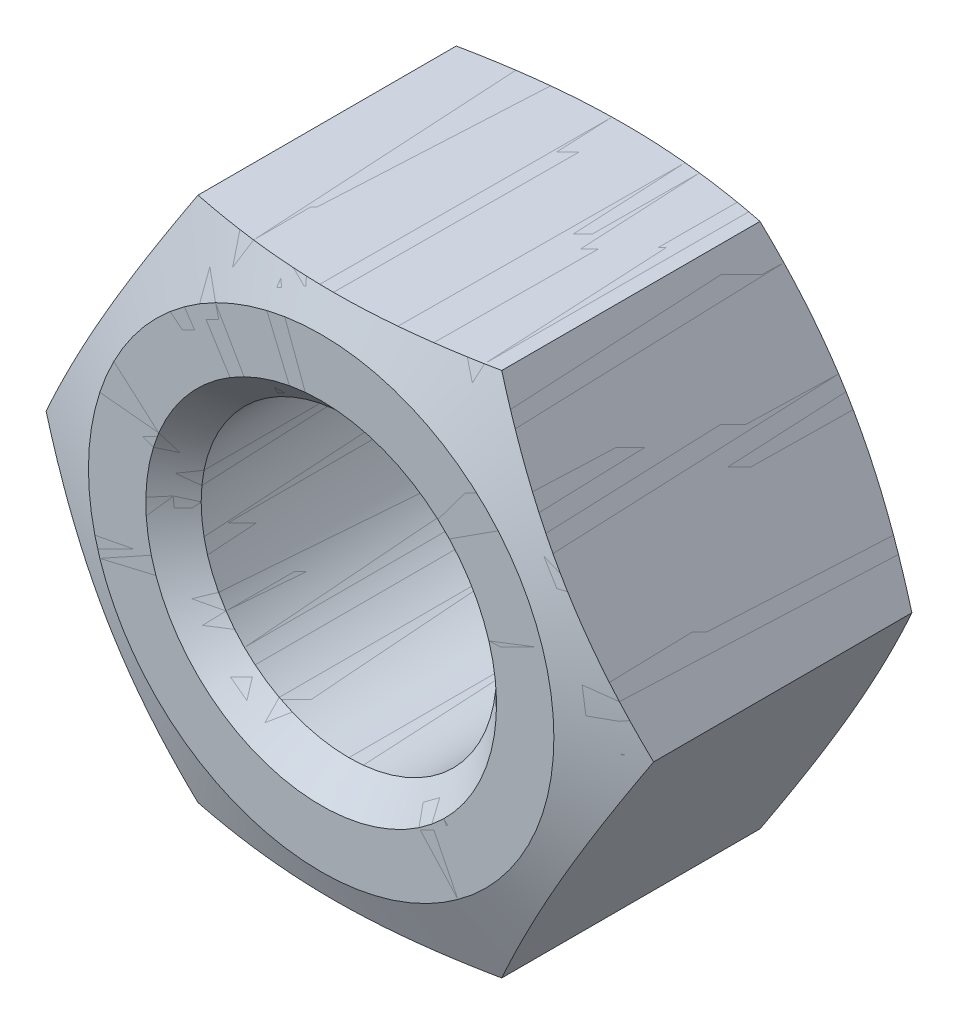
ISO-10303-21;
HEADER;
FILE_DESCRIPTION(('STEP AP214'),'2;1');
FILE_NAME('part.step','',(''),(''),'','','');
FILE_SCHEMA(('AUTOMOTIVE_DESIGN { 1 0 10303 214 1 1 1 1 }'));
ENDSEC;
DATA;
#1=APPLICATION_CONTEXT('core data for automotive mechanical design processes');
#2=APPLICATION_PROTOCOL_DEFINITION('international standard','automotive_design',2000,#1);
#3=PRODUCT_CONTEXT('',#1,'mechanical');
#4=PRODUCT('Part','Part','',(#3));
#5=PRODUCT_RELATED_PRODUCT_CATEGORY('part','',(#4));
#6=PRODUCT_DEFINITION_FORMATION('','',#4);
#7=PRODUCT_DEFINITION_CONTEXT('part definition',#1,'design');
#8=PRODUCT_DEFINITION('design','',#6,#7);
#9=PRODUCT_DEFINITION_SHAPE('','',#8);
#10=(LENGTH_UNIT() NAMED_UNIT(*) SI_UNIT(.MILLI.,.METRE.));
#11=(NAMED_UNIT(*) PLANE_ANGLE_UNIT() SI_UNIT($,.RADIAN.));
#12=(NAMED_UNIT(*) SI_UNIT($,.STERADIAN.) SOLID_ANGLE_UNIT());
#13=UNCERTAINTY_MEASURE_WITH_UNIT(LENGTH_MEASURE(1.E-05),#10,'distance_accuracy_value','');
#14=(GEOMETRIC_REPRESENTATION_CONTEXT(3) GLOBAL_UNCERTAINTY_ASSIGNED_CONTEXT((#13)) GLOBAL_UNIT_ASSIGNED_CONTEXT((#10,
#11,#12)) REPRESENTATION_CONTEXT('',''));
#15=CARTESIAN_POINT('',(0.,0.,0.));
#16=DIRECTION('',(0.,0.,1.));
#17=DIRECTION('',(1.,0.,0.));
#18=AXIS2_PLACEMENT_3D('',#15,#16,#17);
#19=CARTESIAN_POINT('',(10.3923,0.,10.8));
#20=DIRECTION('',(0.,0.,1.));
#21=DIRECTION('',(1.,0.,0.));
#22=AXIS2_PLACEMENT_3D('',#19,#20,#21);
#23=PLANE('',#22);
#24=CARTESIAN_POINT('',(0.,0.,10.8));
#25=DIRECTION('',(0.,0.,-1.));
#26=DIRECTION('',(0.,1.,0.));
#27=AXIS2_PLACEMENT_3D('',#24,#25,#26);
#28=CIRCLE('',#27,6.);
#29=CARTESIAN_POINT('',(0.,6.,10.8));
#30=VERTEX_POINT('',#29);
#31=EDGE_CURVE('P0_E218',#30,#30,#28,.T.);
#32=ORIENTED_EDGE('',*,*,#31,.T.);
#33=EDGE_LOOP('',(#32));
#34=FACE_BOUND('',#33,.T.);
#35=CARTESIAN_POINT('',(0.,0.,10.8));
#36=DIRECTION('',(0.,0.,-1.));
#37=DIRECTION('',(0.,1.,0.));
#38=AXIS2_PLACEMENT_3D('',#35,#36,#37);
#39=CIRCLE('',#38,7.96221472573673);
#40=CARTESIAN_POINT('',(0.,7.96221472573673,10.8));
#41=VERTEX_POINT('',#40);
#42=EDGE_CURVE('P0_E221',#41,#41,#39,.T.);
#43=ORIENTED_EDGE('',*,*,#42,.F.);
#44=EDGE_LOOP('',(#43));
#45=FACE_BOUND('',#44,.T.);
#46=ADVANCED_FACE('P0_F28',(#34,#45),#23,.T.);
#47=CARTESIAN_POINT('',(0.,0.,10.8));
#48=DIRECTION('',(0.,0.,1.));
#49=DIRECTION('',(0.,-1.,0.));
#50=AXIS2_PLACEMENT_3D('',#47,#48,#49);
#51=CONICAL_SURFACE('',#50,6.,0.785398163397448);
#52=CARTESIAN_POINT('',(0.,0.,9.8528125));
#53=DIRECTION('',(0.,0.,-1.));
#54=DIRECTION('',(0.,1.,0.));
#55=AXIS2_PLACEMENT_3D('',#52,#53,#54);
#56=CIRCLE('',#55,5.0528125);
#57=CARTESIAN_POINT('',(0.,5.0528125,9.8528125));
#58=VERTEX_POINT('',#57);
#59=EDGE_CURVE('P0_E109',#58,#58,#56,.T.);
#60=ORIENTED_EDGE('',*,*,#59,.T.);
#61=EDGE_LOOP('',(#60));
#62=FACE_BOUND('',#61,.T.);
#63=ORIENTED_EDGE('',*,*,#31,.F.);
#64=EDGE_LOOP('',(#63));
#65=FACE_BOUND('',#64,.T.);
#66=ADVANCED_FACE('P0_F152',(#62,#65),#51,.F.);
#67=CARTESIAN_POINT('',(0.,0.,0.));
#68=DIRECTION('',(0.,0.,-1.));
#69=DIRECTION('',(0.,1.,0.));
#70=AXIS2_PLACEMENT_3D('',#67,#68,#69);
#71=CYLINDRICAL_SURFACE('',#70,5.0528125);
#72=CARTESIAN_POINT('',(0.,0.,0.9471875));
#73=DIRECTION('',(0.,0.,-1.));
#74=DIRECTION('',(0.,1.,0.));
#75=AXIS2_PLACEMENT_3D('',#72,#73,#74);
#76=CIRCLE('',#75,5.0528125);
#77=CARTESIAN_POINT('',(0.,5.0528125,0.9471875));
#78=VERTEX_POINT('',#77);
#79=EDGE_CURVE('P0_E106',#78,#78,#76,.T.);
#80=ORIENTED_EDGE('',*,*,#79,.T.);
#81=EDGE_LOOP('',(#80));
#82=FACE_BOUND('',#81,.T.);
#83=ORIENTED_EDGE('',*,*,#59,.F.);
#84=EDGE_LOOP('',(#83));
#85=FACE_BOUND('',#84,.T.);
#86=ADVANCED_FACE('P0_F213',(#82,#85),#71,.F.);
#87=CARTESIAN_POINT('',(0.,0.,0.));
#88=DIRECTION('',(0.,0.,-1.));
#89=DIRECTION('',(0.,1.,0.));
#90=AXIS2_PLACEMENT_3D('',#87,#88,#89);
#91=CONICAL_SURFACE('',#90,6.,0.785398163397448);
#92=ORIENTED_EDGE('',*,*,#79,.F.);
#93=EDGE_LOOP('',(#92));
#94=FACE_BOUND('',#93,.T.);
#95=CARTESIAN_POINT('',(0.,0.,0.));
#96=DIRECTION('',(0.,0.,-1.));
#97=DIRECTION('',(0.,1.,0.));
#98=AXIS2_PLACEMENT_3D('',#95,#96,#97);
#99=CIRCLE('',#98,6.);
#100=CARTESIAN_POINT('',(0.,6.,0.));
#101=VERTEX_POINT('',#100);
#102=EDGE_CURVE('P0_E222',#101,#101,#99,.T.);
#103=ORIENTED_EDGE('',*,*,#102,.T.);
#104=EDGE_LOOP('',(#103));
#105=FACE_BOUND('',#104,.T.);
#106=ADVANCED_FACE('P0_F150',(#94,#105),#91,.F.);
#107=CARTESIAN_POINT('',(0.,0.,9.81818181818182));
#108=DIRECTION('',(0.,0.,-1.));
#109=DIRECTION('',(0.,1.,0.));
#110=AXIS2_PLACEMENT_3D('',#107,#108,#109);
#111=CONICAL_SURFACE('',#110,10.3923,1.18682389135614);
#112=ORIENTED_EDGE('',*,*,#42,.T.);
#113=EDGE_LOOP('',(#112));
#114=FACE_BOUND('',#113,.T.);
#115=CARTESIAN_POINT('',(-13.7213175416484,-8.99999580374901,7.38704087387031));
#116=CARTESIAN_POINT('',(-13.3154821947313,-8.99999580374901,7.52410807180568));
#117=CARTESIAN_POINT('',(-12.9091060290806,-8.99999580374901,7.65960359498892));
#118=CARTESIAN_POINT('',(-12.0949922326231,-8.99999580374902,7.92657301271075));
#119=CARTESIAN_POINT('',(-11.6872544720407,-8.99999580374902,8.05804651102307));
#120=CARTESIAN_POINT('',(-10.8692273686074,-8.99999580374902,8.31637893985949));
#121=CARTESIAN_POINT('',(-10.458934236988,-8.99999580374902,8.44322591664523));
#122=CARTESIAN_POINT('',(-9.63649229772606,-8.99999580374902,8.69074149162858));
#123=CARTESIAN_POINT('',(-9.22434353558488,-8.99999580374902,8.81141024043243));
#124=CARTESIAN_POINT('',(-8.40325061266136,-8.99999580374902,9.04348728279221));
#125=CARTESIAN_POINT('',(-7.99433497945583,-8.99999580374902,9.15499600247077));
#126=CARTESIAN_POINT('',(-7.17401440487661,-8.99999580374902,9.36856929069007));
#127=CARTESIAN_POINT('',(-6.76260939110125,-8.99999580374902,9.4706335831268));
#128=CARTESIAN_POINT('',(-5.93725312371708,-8.99999580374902,9.66287394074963));
#129=CARTESIAN_POINT('',(-5.52330344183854,-8.99999580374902,9.75305669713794));
#130=CARTESIAN_POINT('',(-4.69246299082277,-8.99999580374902,9.91874089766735));
#131=CARTESIAN_POINT('',(-4.27557243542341,-8.99999580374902,9.9942433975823));
#132=CARTESIAN_POINT('',(-3.52449813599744,-8.99999580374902,10.1137799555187));
#133=CARTESIAN_POINT('',(-3.19083872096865,-8.99999580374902,10.1610917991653));
#134=CARTESIAN_POINT('',(-2.52193448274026,-8.99999580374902,10.2428429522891));
#135=CARTESIAN_POINT('',(-2.18668970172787,-8.99999580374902,10.2772826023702));
#136=CARTESIAN_POINT('',(-1.51524560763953,-8.99999580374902,10.3319256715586));
#137=CARTESIAN_POINT('',(-1.17904705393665,-8.99999580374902,10.3521383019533));
#138=CARTESIAN_POINT('',(-0.506076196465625,-8.99999580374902,10.3774805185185));
#139=CARTESIAN_POINT('',(-0.169303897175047,-8.99999580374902,10.3826102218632));
#140=CARTESIAN_POINT('',(0.505787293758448,-8.99999580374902,10.377537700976));
#141=CARTESIAN_POINT('',(0.844105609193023,-8.99999580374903,10.3672596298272));
#142=CARTESIAN_POINT('',(1.51994715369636,-8.99999580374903,10.331704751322));
#143=CARTESIAN_POINT('',(1.85747036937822,-8.99999580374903,10.3064276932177));
#144=CARTESIAN_POINT('',(2.53138341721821,-8.99999580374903,10.241934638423));
#145=CARTESIAN_POINT('',(2.8677723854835,-8.99999580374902,10.2027097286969));
#146=CARTESIAN_POINT('',(3.53883977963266,-8.99999580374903,10.1117979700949));
#147=CARTESIAN_POINT('',(3.87351821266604,-8.99999580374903,10.0601111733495));
#148=CARTESIAN_POINT('',(4.60141065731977,-8.99999580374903,9.93557188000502));
#149=CARTESIAN_POINT('',(4.99425661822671,-8.99999580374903,9.86058175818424));
#150=CARTESIAN_POINT('',(5.77737783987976,-8.99999580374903,9.69811196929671));
#151=CARTESIAN_POINT('',(6.16765276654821,-8.99999580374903,9.61063071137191));
#152=CARTESIAN_POINT('',(6.94596724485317,-8.99999580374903,9.42546693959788));
#153=CARTESIAN_POINT('',(7.3340055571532,-8.99999580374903,9.32777925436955));
#154=CARTESIAN_POINT('',(8.10789314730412,-8.99999580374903,9.12419398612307));
#155=CARTESIAN_POINT('',(8.49374250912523,-8.99999580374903,9.01829672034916));
#156=CARTESIAN_POINT('',(9.26458077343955,-8.99999580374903,8.7995754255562));
#157=CARTESIAN_POINT('',(9.64956460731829,-8.99999580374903,8.68673361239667));
#158=CARTESIAN_POINT('',(10.4179038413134,-8.99999580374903,8.45564514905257));
#159=CARTESIAN_POINT('',(10.8012592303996,-8.99999580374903,8.33739846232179));
#160=CARTESIAN_POINT('',(11.5664713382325,-8.99999580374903,8.09653709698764));
#161=CARTESIAN_POINT('',(11.9483284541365,-8.99999580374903,7.97392367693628));
#162=CARTESIAN_POINT('',(12.7108635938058,-8.99999580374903,7.72507883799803));
#163=CARTESIAN_POINT('',(13.0915416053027,-8.99999580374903,7.59884738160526));
#164=CARTESIAN_POINT('',(14.2266278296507,-8.99999580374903,7.21752754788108));
#165=CARTESIAN_POINT('',(14.979566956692,-8.99999580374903,6.95806764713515));
#166=CARTESIAN_POINT('',(16.4826182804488,-8.99999580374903,6.43094829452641));
#167=CARTESIAN_POINT('',(17.2327302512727,-8.99999580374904,6.16328820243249));
#168=CARTESIAN_POINT('',(18.7257842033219,-8.99999580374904,5.62384855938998));
#169=CARTESIAN_POINT('',(19.468740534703,-8.99999580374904,5.35210866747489));
#170=CARTESIAN_POINT('',(20.5819171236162,-8.99999580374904,4.94124615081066));
#171=CARTESIAN_POINT('',(20.9527427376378,-8.99999580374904,4.8037587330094));
#172=CARTESIAN_POINT('',(21.6940363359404,-8.99999580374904,4.52782700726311));
#173=CARTESIAN_POINT('',(22.0645043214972,-8.99999580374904,4.38938270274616));
#174=CARTESIAN_POINT('',(22.4348177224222,-8.99999580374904,4.2505259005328));
#175=B_SPLINE_CURVE_WITH_KNOTS('',3,(#115,#116,#117,#118,#119,#120,#121,#122,#123,#124,#125,
#126,#127,#128,#129,#130,#131,#132,#133,#134,#135,#136,#137,#138,#139,#140,#141,#142,#143,#144,
#145,#146,#147,#148,#149,#150,#151,#152,#153,#154,#155,#156,#157,#158,#159,#160,#161,#162,#163,
#164,#165,#166,#167,#168,#169,#170,#171,#172,#173,#174),.UNSPECIFIED.,.F.,.F.,(4,2,2,2,2,2,2,2,
2,2,2,2,2,2,2,2,2,2,2,2,2,2,2,2,2,2,2,2,2,4),(0.,1.2850820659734,2.57029032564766,
3.8586128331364,5.14690392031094,6.41835594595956,7.68984513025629,8.96061517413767,
10.2312937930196,11.2420693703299,12.2528182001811,13.2629120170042,14.2729979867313,
15.2880725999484,16.303164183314,17.3189056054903,18.334642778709,19.5342055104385,
20.7339211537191,21.9342476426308,23.1345277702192,24.3380210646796,25.5415224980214,
26.7446798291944,27.9478496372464,30.3369407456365,32.7262188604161,35.0994753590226,
36.2859523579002,37.4724251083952),.UNSPECIFIED.);
#176=CARTESIAN_POINT('',(-5.19615,-8.99999580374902,9.81818181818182));
#177=VERTEX_POINT('',#176);
#178=CARTESIAN_POINT('',(5.19615,-8.99999580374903,9.81818181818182));
#179=VERTEX_POINT('',#178);
#180=EDGE_CURVE('P0_E89',#177,#179,#175,.T.);
#181=ORIENTED_EDGE('',*,*,#180,.T.);
#182=CARTESIAN_POINT('',(5.19614988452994,-8.99999600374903,9.81818177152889));
#183=CARTESIAN_POINT('',(5.37768933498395,-8.68556045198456,9.89153268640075));
#184=CARTESIAN_POINT('',(5.55982797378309,-8.37008707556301,9.9593574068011));
#185=CARTESIAN_POINT('',(5.92530962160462,-7.73705429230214,10.0818698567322));
#186=CARTESIAN_POINT('',(6.10865327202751,-7.41949377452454,10.136549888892));
#187=CARTESIAN_POINT('',(6.47628397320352,-6.78273872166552,10.2305837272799));
#188=CARTESIAN_POINT('',(6.66057072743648,-6.46354470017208,10.2699420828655));
#189=CARTESIAN_POINT('',(7.02982878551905,-5.82397098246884,10.3315086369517));
#190=CARTESIAN_POINT('',(7.21479992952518,-5.50359156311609,10.3537206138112));
#191=CARTESIAN_POINT('',(7.58192629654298,-4.86771004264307,10.3796131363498));
#192=CARTESIAN_POINT('',(7.76407600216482,-4.55221749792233,10.3836019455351));
#193=CARTESIAN_POINT('',(8.12826777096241,-3.92141885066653,10.3736718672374));
#194=CARTESIAN_POINT('',(8.31030982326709,-3.60611276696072,10.3597514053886));
#195=CARTESIAN_POINT('',(8.6737364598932,-2.97663936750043,10.3147511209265));
#196=CARTESIAN_POINT('',(8.85512138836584,-2.66247145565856,10.2836822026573));
#197=CARTESIAN_POINT('',(9.21702522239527,-2.03563562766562,10.2058906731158));
#198=CARTESIAN_POINT('',(9.39754421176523,-1.72296756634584,10.1591696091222));
#199=CARTESIAN_POINT('',(9.64562758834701,-1.29327455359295,10.0853171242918));
#200=CARTESIAN_POINT('',(9.71364398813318,-1.17546669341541,10.064064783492));
#201=CARTESIAN_POINT('',(9.8495162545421,-0.940129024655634,10.0197094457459));
#202=CARTESIAN_POINT('',(9.91737214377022,-0.822599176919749,9.99660672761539));
#203=CARTESIAN_POINT('',(10.053161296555,-0.587405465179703,9.94857527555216));
#204=CARTESIAN_POINT('',(10.1210940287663,-0.469742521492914,9.92364055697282));
#205=CARTESIAN_POINT('',(10.2568106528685,-0.234674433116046,9.87212109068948));
#206=CARTESIAN_POINT('',(10.324594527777,-0.117269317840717,9.84553616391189));
#207=CARTESIAN_POINT('',(10.39230011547,1.99999999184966E-07,9.81818177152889));
#208=B_SPLINE_CURVE_WITH_KNOTS('',3,(#182,#183,#184,#185,#186,#187,#188,#189,#190,#191,#192,
#193,#194,#195,#196,#197,#198,#199,#200,#201,#202,#203,#204,#205,#206,#207),.UNSPECIFIED.,.F.,
.F.,(4,2,2,2,2,2,2,2,2,2,2,2,4),(0.,1.1113202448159,2.22328968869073,3.33492871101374,
4.44632270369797,5.53884497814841,6.63146330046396,7.7233876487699,8.81520408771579,
9.22824501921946,9.64122383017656,10.0556174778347,10.4700561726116),.UNSPECIFIED.);
#209=CARTESIAN_POINT('',(10.3923,0.,9.81818181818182));
#210=VERTEX_POINT('',#209);
#211=EDGE_CURVE('P0_E174',#179,#210,#208,.T.);
#212=ORIENTED_EDGE('',*,*,#211,.T.);
#213=CARTESIAN_POINT('',(10.39230011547,-1.99999999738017E-07,9.81818177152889));
#214=CARTESIAN_POINT('',(10.210760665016,0.314435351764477,9.89153268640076));
#215=CARTESIAN_POINT('',(10.0286220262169,0.629908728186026,9.9593574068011));
#216=CARTESIAN_POINT('',(9.66314037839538,1.2629415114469,10.0818698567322));
#217=CARTESIAN_POINT('',(9.47979672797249,1.5805020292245,10.136549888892));
#218=CARTESIAN_POINT('',(9.11216602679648,2.21725708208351,10.2305837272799));
#219=CARTESIAN_POINT('',(8.92787927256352,2.53645110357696,10.2699420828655));
#220=CARTESIAN_POINT('',(8.55862121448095,3.1760248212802,10.3315086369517));
#221=CARTESIAN_POINT('',(8.37365007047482,3.49640424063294,10.3537206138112));
#222=CARTESIAN_POINT('',(8.00652370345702,4.13228576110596,10.3796131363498));
#223=CARTESIAN_POINT('',(7.82437399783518,4.4477783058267,10.3836019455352));
#224=CARTESIAN_POINT('',(7.46018222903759,5.0785769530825,10.3736718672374));
#225=CARTESIAN_POINT('',(7.27814017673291,5.39388303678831,10.3597514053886));
#226=CARTESIAN_POINT('',(6.91471354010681,6.0233564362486,10.3147511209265));
#227=CARTESIAN_POINT('',(6.73332861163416,6.33752434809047,10.2836822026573));
#228=CARTESIAN_POINT('',(6.37142477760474,6.96436017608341,10.2058906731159));
#229=CARTESIAN_POINT('',(6.19090578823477,7.27702823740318,10.1591696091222));
#230=CARTESIAN_POINT('',(5.94282241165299,7.70672125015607,10.0853171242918));
#231=CARTESIAN_POINT('',(5.87480601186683,7.82452911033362,10.064064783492));
#232=CARTESIAN_POINT('',(5.73893374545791,8.05986677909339,10.0197094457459));
#233=CARTESIAN_POINT('',(5.67107785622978,8.17739662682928,9.99660672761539));
#234=CARTESIAN_POINT('',(5.53528870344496,8.41259033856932,9.94857527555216));
#235=CARTESIAN_POINT('',(5.46735597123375,8.53025328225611,9.92364055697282));
#236=CARTESIAN_POINT('',(5.33163934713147,8.76532137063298,9.87212109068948));
#237=CARTESIAN_POINT('',(5.26385547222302,8.88272648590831,9.84553616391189));
#238=CARTESIAN_POINT('',(5.19614988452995,8.99999600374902,9.81818177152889));
#239=B_SPLINE_CURVE_WITH_KNOTS('',3,(#213,#214,#215,#216,#217,#218,#219,#220,#221,#222,#223,
#224,#225,#226,#227,#228,#229,#230,#231,#232,#233,#234,#235,#236,#237,#238),.UNSPECIFIED.,.F.,
.F.,(4,2,2,2,2,2,2,2,2,2,2,2,4),(0.,1.1113202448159,2.22328968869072,3.33492871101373,
4.44632270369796,5.5388449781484,6.63146330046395,7.72338764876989,8.81520408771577,
9.22824501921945,9.64122383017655,10.0556174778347,10.4700561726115),.UNSPECIFIED.);
#240=CARTESIAN_POINT('',(5.19615,8.99999580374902,9.81818181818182));
#241=VERTEX_POINT('',#240);
#242=EDGE_CURVE('P0_E51',#210,#241,#239,.T.);
#243=ORIENTED_EDGE('',*,*,#242,.T.);
#244=CARTESIAN_POINT('',(-13.7213175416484,8.99999580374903,7.38704087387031));
#245=CARTESIAN_POINT('',(-13.3154821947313,8.99999580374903,7.52410807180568));
#246=CARTESIAN_POINT('',(-12.9091060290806,8.99999580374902,7.65960359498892));
#247=CARTESIAN_POINT('',(-12.0949922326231,8.99999580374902,7.92657301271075));
#248=CARTESIAN_POINT('',(-11.6872544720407,8.99999580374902,8.05804651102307));
#249=CARTESIAN_POINT('',(-10.8692273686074,8.99999580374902,8.31637893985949));
#250=CARTESIAN_POINT('',(-10.458934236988,8.99999580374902,8.44322591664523));
#251=CARTESIAN_POINT('',(-9.63649229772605,8.99999580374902,8.69074149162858));
#252=CARTESIAN_POINT('',(-9.22434353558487,8.99999580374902,8.81141024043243));
#253=CARTESIAN_POINT('',(-8.40325061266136,8.99999580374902,9.04348728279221));
#254=CARTESIAN_POINT('',(-7.99433497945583,8.99999580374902,9.15499600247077));
#255=CARTESIAN_POINT('',(-7.17401440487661,8.99999580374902,9.36856929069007));
#256=CARTESIAN_POINT('',(-6.76260939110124,8.99999580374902,9.4706335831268));
#257=CARTESIAN_POINT('',(-5.93725312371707,8.99999580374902,9.66287394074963));
#258=CARTESIAN_POINT('',(-5.52330344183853,8.99999580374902,9.75305669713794));
#259=CARTESIAN_POINT('',(-4.69246299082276,8.99999580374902,9.91874089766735));
#260=CARTESIAN_POINT('',(-4.2755724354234,8.99999580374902,9.9942433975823));
#261=CARTESIAN_POINT('',(-3.52449813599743,8.99999580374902,10.1137799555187));
#262=CARTESIAN_POINT('',(-3.19083872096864,8.99999580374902,10.1610917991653));
#263=CARTESIAN_POINT('',(-2.52193448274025,8.99999580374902,10.2428429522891));
#264=CARTESIAN_POINT('',(-2.18668970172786,8.99999580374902,10.2772826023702));
#265=CARTESIAN_POINT('',(-1.51524560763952,8.99999580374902,10.3319256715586));
#266=CARTESIAN_POINT('',(-1.17904705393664,8.99999580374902,10.3521383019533));
#267=CARTESIAN_POINT('',(-0.506076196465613,8.99999580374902,10.3774805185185));
#268=CARTESIAN_POINT('',(-0.169303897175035,8.99999580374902,10.3826102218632));
#269=CARTESIAN_POINT('',(0.505787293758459,8.99999580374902,10.377537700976));
#270=CARTESIAN_POINT('',(0.844105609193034,8.99999580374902,10.3672596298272));
#271=CARTESIAN_POINT('',(1.51994715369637,8.99999580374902,10.331704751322));
#272=CARTESIAN_POINT('',(1.85747036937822,8.99999580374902,10.3064276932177));
#273=CARTESIAN_POINT('',(2.53138341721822,8.99999580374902,10.241934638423));
#274=CARTESIAN_POINT('',(2.86777238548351,8.99999580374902,10.2027097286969));
#275=CARTESIAN_POINT('',(3.53883977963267,8.99999580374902,10.1117979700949));
#276=CARTESIAN_POINT('',(3.87351821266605,8.99999580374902,10.0601111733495));
#277=CARTESIAN_POINT('',(4.60141065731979,8.99999580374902,9.93557188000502));
#278=CARTESIAN_POINT('',(4.99425661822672,8.99999580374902,9.86058175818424));
#279=CARTESIAN_POINT('',(5.77737783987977,8.99999580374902,9.69811196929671));
#280=CARTESIAN_POINT('',(6.16765276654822,8.99999580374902,9.61063071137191));
#281=CARTESIAN_POINT('',(6.94596724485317,8.99999580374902,9.42546693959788));
#282=CARTESIAN_POINT('',(7.3340055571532,8.99999580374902,9.32777925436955));
#283=CARTESIAN_POINT('',(8.10789314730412,8.99999580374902,9.12419398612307));
#284=CARTESIAN_POINT('',(8.49374250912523,8.99999580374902,9.01829672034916));
#285=CARTESIAN_POINT('',(9.26458077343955,8.99999580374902,8.7995754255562));
#286=CARTESIAN_POINT('',(9.6495646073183,8.99999580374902,8.68673361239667));
#287=CARTESIAN_POINT('',(10.4179038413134,8.99999580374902,8.45564514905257));
#288=CARTESIAN_POINT('',(10.8012592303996,8.99999580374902,8.33739846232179));
#289=CARTESIAN_POINT('',(11.5664713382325,8.99999580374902,8.09653709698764));
#290=CARTESIAN_POINT('',(11.9483284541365,8.99999580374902,7.97392367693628));
#291=CARTESIAN_POINT('',(12.7108635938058,8.99999580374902,7.72507883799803));
#292=CARTESIAN_POINT('',(13.0915416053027,8.99999580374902,7.59884738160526));
#293=CARTESIAN_POINT('',(14.2266278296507,8.99999580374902,7.21752754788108));
#294=CARTESIAN_POINT('',(14.979566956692,8.99999580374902,6.95806764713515));
#295=CARTESIAN_POINT('',(16.4826182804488,8.99999580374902,6.43094829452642));
#296=CARTESIAN_POINT('',(17.2327302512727,8.99999580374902,6.16328820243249));
#297=CARTESIAN_POINT('',(18.7257842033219,8.99999580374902,5.62384855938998));
#298=CARTESIAN_POINT('',(19.468740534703,8.99999580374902,5.35210866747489));
#299=CARTESIAN_POINT('',(20.5819171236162,8.99999580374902,4.94124615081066));
#300=CARTESIAN_POINT('',(20.9527427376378,8.99999580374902,4.8037587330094));
#301=CARTESIAN_POINT('',(21.6940363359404,8.99999580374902,4.52782700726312));
#302=CARTESIAN_POINT('',(22.0645043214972,8.99999580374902,4.38938270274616));
#303=CARTESIAN_POINT('',(22.4348177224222,8.99999580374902,4.2505259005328));
#304=B_SPLINE_CURVE_WITH_KNOTS('',3,(#244,#245,#246,#247,#248,#249,#250,#251,#252,#253,#254,
#255,#256,#257,#258,#259,#260,#261,#262,#263,#264,#265,#266,#267,#268,#269,#270,#271,#272,#273,
#274,#275,#276,#277,#278,#279,#280,#281,#282,#283,#284,#285,#286,#287,#288,#289,#290,#291,#292,
#293,#294,#295,#296,#297,#298,#299,#300,#301,#302,#303),.UNSPECIFIED.,.F.,.F.,(4,2,2,2,2,2,2,2,
2,2,2,2,2,2,2,2,2,2,2,2,2,2,2,2,2,2,2,2,2,4),(0.,1.2850820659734,2.57029032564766,
3.8586128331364,5.14690392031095,6.41835594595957,7.6898451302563,8.96061517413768,
10.2312937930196,11.2420693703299,12.2528182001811,13.2629120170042,14.2729979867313,
15.2880725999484,16.303164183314,17.3189056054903,18.334642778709,19.5342055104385,
20.7339211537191,21.9342476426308,23.1345277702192,24.3380210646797,25.5415224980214,
26.7446798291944,27.9478496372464,30.3369407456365,32.7262188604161,35.0994753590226,
36.2859523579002,37.4724251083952),.UNSPECIFIED.);
#305=CARTESIAN_POINT('',(-5.19615,8.99999580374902,9.81818181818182));
#306=VERTEX_POINT('',#305);
#307=EDGE_CURVE('P0_E165',#241,#306,#304,.F.);
#308=ORIENTED_EDGE('',*,*,#307,.T.);
#309=CARTESIAN_POINT('',(-5.19614988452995,8.99999600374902,9.81818177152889));
#310=CARTESIAN_POINT('',(-5.37768933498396,8.68556045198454,9.89153268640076));
#311=CARTESIAN_POINT('',(-5.5598279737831,8.370087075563,9.9593574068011));
#312=CARTESIAN_POINT('',(-5.92530962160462,7.73705429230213,10.0818698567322));
#313=CARTESIAN_POINT('',(-6.10865327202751,7.41949377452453,10.136549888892));
#314=CARTESIAN_POINT('',(-6.47628397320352,6.78273872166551,10.2305837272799));
#315=CARTESIAN_POINT('',(-6.66057072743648,6.46354470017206,10.2699420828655));
#316=CARTESIAN_POINT('',(-7.02982878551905,5.82397098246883,10.3315086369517));
#317=CARTESIAN_POINT('',(-7.21479992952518,5.50359156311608,10.3537206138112));
#318=CARTESIAN_POINT('',(-7.58192629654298,4.86771004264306,10.3796131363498));
#319=CARTESIAN_POINT('',(-7.76407600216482,4.55221749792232,10.3836019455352));
#320=CARTESIAN_POINT('',(-8.12826777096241,3.92141885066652,10.3736718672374));
#321=CARTESIAN_POINT('',(-8.31030982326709,3.60611276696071,10.3597514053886));
#322=CARTESIAN_POINT('',(-8.67373645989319,2.97663936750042,10.3147511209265));
#323=CARTESIAN_POINT('',(-8.85512138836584,2.66247145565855,10.2836822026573));
#324=CARTESIAN_POINT('',(-9.21702522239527,2.03563562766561,10.2058906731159));
#325=CARTESIAN_POINT('',(-9.39754421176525,1.72296756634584,10.1591696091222));
#326=CARTESIAN_POINT('',(-9.64562758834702,1.29327455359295,10.0853171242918));
#327=CARTESIAN_POINT('',(-9.71364398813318,1.1754666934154,10.064064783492));
#328=CARTESIAN_POINT('',(-9.84951625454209,0.940129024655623,10.0197094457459));
#329=CARTESIAN_POINT('',(-9.91737214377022,0.822599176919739,9.99660672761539));
#330=CARTESIAN_POINT('',(-10.053161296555,0.587405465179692,9.94857527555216));
#331=CARTESIAN_POINT('',(-10.1210940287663,0.469742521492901,9.92364055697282));
#332=CARTESIAN_POINT('',(-10.2568106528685,0.234674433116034,9.87212109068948));
#333=CARTESIAN_POINT('',(-10.324594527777,0.117269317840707,9.84553616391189));
#334=CARTESIAN_POINT('',(-10.3923001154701,-2.00000000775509E-07,9.81818177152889));
#335=B_SPLINE_CURVE_WITH_KNOTS('',3,(#309,#310,#311,#312,#313,#314,#315,#316,#317,#318,#319,
#320,#321,#322,#323,#324,#325,#326,#327,#328,#329,#330,#331,#332,#333,#334),.UNSPECIFIED.,.F.,
.F.,(4,2,2,2,2,2,2,2,2,2,2,2,4),(0.,1.1113202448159,2.22328968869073,3.33492871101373,
4.44632270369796,5.5388449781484,6.63146330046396,7.7233876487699,8.81520408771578,
9.22824501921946,9.64122383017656,10.0556174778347,10.4700561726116),.UNSPECIFIED.);
#336=CARTESIAN_POINT('',(-10.3923,0.,9.81818181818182));
#337=VERTEX_POINT('',#336);
#338=EDGE_CURVE('P0_E160',#306,#337,#335,.T.);
#339=ORIENTED_EDGE('',*,*,#338,.T.);
#340=CARTESIAN_POINT('',(-10.39230011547,1.9999999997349E-07,9.81818177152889));
#341=CARTESIAN_POINT('',(-10.210760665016,-0.314435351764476,9.89153268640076));
#342=CARTESIAN_POINT('',(-10.0286220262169,-0.629908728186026,9.9593574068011));
#343=CARTESIAN_POINT('',(-9.66314037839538,-1.2629415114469,10.0818698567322));
#344=CARTESIAN_POINT('',(-9.47979672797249,-1.5805020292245,10.136549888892));
#345=CARTESIAN_POINT('',(-9.11216602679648,-2.21725708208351,10.2305837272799));
#346=CARTESIAN_POINT('',(-8.92787927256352,-2.53645110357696,10.2699420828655));
#347=CARTESIAN_POINT('',(-8.55862121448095,-3.17602482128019,10.3315086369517));
#348=CARTESIAN_POINT('',(-8.37365007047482,-3.49640424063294,10.3537206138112));
#349=CARTESIAN_POINT('',(-8.00652370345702,-4.13228576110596,10.3796131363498));
#350=CARTESIAN_POINT('',(-7.82437399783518,-4.4477783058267,10.3836019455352));
#351=CARTESIAN_POINT('',(-7.46018222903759,-5.0785769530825,10.3736718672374));
#352=CARTESIAN_POINT('',(-7.27814017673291,-5.39388303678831,10.3597514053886));
#353=CARTESIAN_POINT('',(-6.91471354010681,-6.0233564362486,10.3147511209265));
#354=CARTESIAN_POINT('',(-6.73332861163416,-6.33752434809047,10.2836822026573));
#355=CARTESIAN_POINT('',(-6.37142477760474,-6.96436017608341,10.2058906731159));
#356=CARTESIAN_POINT('',(-6.19090578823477,-7.27702823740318,10.1591696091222));
#357=CARTESIAN_POINT('',(-5.94282241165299,-7.70672125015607,10.0853171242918));
#358=CARTESIAN_POINT('',(-5.87480601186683,-7.82452911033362,10.064064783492));
#359=CARTESIAN_POINT('',(-5.73893374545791,-8.05986677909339,10.0197094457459));
#360=CARTESIAN_POINT('',(-5.67107785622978,-8.17739662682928,9.99660672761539));
#361=CARTESIAN_POINT('',(-5.53528870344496,-8.41259033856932,9.94857527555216));
#362=CARTESIAN_POINT('',(-5.46735597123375,-8.53025328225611,9.92364055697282));
#363=CARTESIAN_POINT('',(-5.33163934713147,-8.76532137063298,9.87212109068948));
#364=CARTESIAN_POINT('',(-5.26385547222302,-8.88272648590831,9.84553616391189));
#365=CARTESIAN_POINT('',(-5.19614988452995,-8.99999600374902,9.81818177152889));
#366=B_SPLINE_CURVE_WITH_KNOTS('',3,(#340,#341,#342,#343,#344,#345,#346,#347,#348,#349,#350,
#351,#352,#353,#354,#355,#356,#357,#358,#359,#360,#361,#362,#363,#364,#365),.UNSPECIFIED.,.F.,
.F.,(4,2,2,2,2,2,2,2,2,2,2,2,4),(0.,1.1113202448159,2.22328968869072,3.33492871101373,
4.44632270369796,5.5388449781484,6.63146330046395,7.72338764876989,8.81520408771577,
9.22824501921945,9.64122383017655,10.0556174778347,10.4700561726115),.UNSPECIFIED.);
#367=EDGE_CURVE('P0_E137',#337,#177,#366,.T.);
#368=ORIENTED_EDGE('',*,*,#367,.T.);
#369=EDGE_LOOP('',(#181,#212,#243,#308,#339,#368));
#370=FACE_BOUND('',#369,.T.);
#371=ADVANCED_FACE('P0_F146',(#114,#370),#111,.T.);
#372=CARTESIAN_POINT('',(5.19615,-8.99999580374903,10.8));
#373=DIRECTION('',(-0.866025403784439,0.5,0.));
#374=DIRECTION('',(-0.5,-0.866025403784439,0.));
#375=AXIS2_PLACEMENT_3D('',#372,#373,#374);
#376=PLANE('',#375);
#377=ORIENTED_EDGE('',*,*,#211,.F.);
#378=DIRECTION('',(0.,0.,-1.));
#379=VECTOR('',#378,1.);
#380=CARTESIAN_POINT('',(5.19615,-8.99999580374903,10.8));
#381=LINE('',#380,#379);
#382=CARTESIAN_POINT('',(5.19615,-8.99999580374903,0.981818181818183));
#383=VERTEX_POINT('',#382);
#384=EDGE_CURVE('P0_E93',#179,#383,#381,.T.);
#385=ORIENTED_EDGE('',*,*,#384,.T.);
#386=CARTESIAN_POINT('',(10.3923001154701,2.E-07,0.981818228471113));
#387=CARTESIAN_POINT('',(10.2107606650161,-0.31443535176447,0.908467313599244));
#388=CARTESIAN_POINT('',(10.0286220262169,-0.629908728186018,0.840642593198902));
#389=CARTESIAN_POINT('',(9.66314037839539,-1.26294151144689,0.718130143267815));
#390=CARTESIAN_POINT('',(9.4797967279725,-1.58050202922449,0.663450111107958));
#391=CARTESIAN_POINT('',(9.11216602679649,-2.21725708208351,0.569416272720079));
#392=CARTESIAN_POINT('',(8.92787927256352,-2.53645110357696,0.530057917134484));
#393=CARTESIAN_POINT('',(8.55862121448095,-3.1760248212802,0.468491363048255));
#394=CARTESIAN_POINT('',(8.37365007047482,-3.49640424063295,0.446279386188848));
#395=CARTESIAN_POINT('',(8.00652370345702,-4.13228576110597,0.420386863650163));
#396=CARTESIAN_POINT('',(7.82437399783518,-4.44777830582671,0.416398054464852));
#397=CARTESIAN_POINT('',(7.46018222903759,-5.07857695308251,0.426328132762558));
#398=CARTESIAN_POINT('',(7.27814017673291,-5.39388303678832,0.440248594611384));
#399=CARTESIAN_POINT('',(6.91471354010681,-6.02335643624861,0.485248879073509));
#400=CARTESIAN_POINT('',(6.73332861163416,-6.33752434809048,0.51631779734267));
#401=CARTESIAN_POINT('',(6.37142477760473,-6.96436017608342,0.594109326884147));
#402=CARTESIAN_POINT('',(6.19090578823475,-7.27702823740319,0.640830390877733));
#403=CARTESIAN_POINT('',(5.94282241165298,-7.70672125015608,0.71468287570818));
#404=CARTESIAN_POINT('',(5.87480601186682,-7.82452911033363,0.735935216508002));
#405=CARTESIAN_POINT('',(5.73893374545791,-8.0598667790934,0.780290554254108));
#406=CARTESIAN_POINT('',(5.67107785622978,-8.17739662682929,0.803393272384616));
#407=CARTESIAN_POINT('',(5.53528870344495,-8.41259033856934,0.851424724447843));
#408=CARTESIAN_POINT('',(5.46735597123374,-8.53025328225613,0.876359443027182));
#409=CARTESIAN_POINT('',(5.33163934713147,-8.76532137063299,0.927878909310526));
#410=CARTESIAN_POINT('',(5.26385547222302,-8.88272648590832,0.954463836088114));
#411=CARTESIAN_POINT('',(5.19614988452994,-8.99999600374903,0.981818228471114));
#412=B_SPLINE_CURVE_WITH_KNOTS('',3,(#386,#387,#388,#389,#390,#391,#392,#393,#394,#395,#396,
#397,#398,#399,#400,#401,#402,#403,#404,#405,#406,#407,#408,#409,#410,#411),.UNSPECIFIED.,.F.,
.F.,(4,2,2,2,2,2,2,2,2,2,2,2,4),(0.,1.1113202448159,2.22328968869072,3.33492871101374,
4.44632270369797,5.53884497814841,6.63146330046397,7.72338764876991,8.81520408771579,
9.22824501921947,9.64122383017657,10.0556174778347,10.4700561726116),.UNSPECIFIED.);
#413=CARTESIAN_POINT('',(10.3923,0.,0.981818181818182));
#414=VERTEX_POINT('',#413);
#415=EDGE_CURVE('P0_E44',#414,#383,#412,.T.);
#416=ORIENTED_EDGE('',*,*,#415,.F.);
#417=DIRECTION('',(0.,0.,-1.));
#418=VECTOR('',#417,1.);
#419=CARTESIAN_POINT('',(10.3923,0.,10.8));
#420=LINE('',#419,#418);
#421=EDGE_CURVE('P0_E37',#210,#414,#420,.T.);
#422=ORIENTED_EDGE('',*,*,#421,.F.);
#423=EDGE_LOOP('',(#377,#385,#416,#422));
#424=FACE_BOUND('',#423,.T.);
#425=ADVANCED_FACE('P0_F30',(#424),#376,.F.);
#426=CARTESIAN_POINT('',(10.3923,0.,10.8));
#427=DIRECTION('',(-0.866025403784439,-0.5,0.));
#428=DIRECTION('',(0.5,-0.866025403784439,0.));
#429=AXIS2_PLACEMENT_3D('',#426,#427,#428);
#430=PLANE('',#429);
#431=ORIENTED_EDGE('',*,*,#242,.F.);
#432=ORIENTED_EDGE('',*,*,#421,.T.);
#433=CARTESIAN_POINT('',(5.19614988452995,8.99999600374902,0.981818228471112));
#434=CARTESIAN_POINT('',(5.37768933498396,8.68556045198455,0.908467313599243));
#435=CARTESIAN_POINT('',(5.5598279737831,8.370087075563,0.8406425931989));
#436=CARTESIAN_POINT('',(5.92530962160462,7.73705429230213,0.718130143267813));
#437=CARTESIAN_POINT('',(6.10865327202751,7.41949377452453,0.663450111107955));
#438=CARTESIAN_POINT('',(6.47628397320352,6.78273872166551,0.569416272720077));
#439=CARTESIAN_POINT('',(6.66057072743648,6.46354470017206,0.530057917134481));
#440=CARTESIAN_POINT('',(7.02982878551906,5.82397098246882,0.468491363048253));
#441=CARTESIAN_POINT('',(7.21479992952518,5.50359156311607,0.446279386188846));
#442=CARTESIAN_POINT('',(7.58192629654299,4.86771004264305,0.420386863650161));
#443=CARTESIAN_POINT('',(7.76407600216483,4.55221749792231,0.41639805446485));
#444=CARTESIAN_POINT('',(8.12826777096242,3.92141885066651,0.426328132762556));
#445=CARTESIAN_POINT('',(8.3103098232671,3.6061127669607,0.440248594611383));
#446=CARTESIAN_POINT('',(8.6737364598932,2.97663936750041,0.485248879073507));
#447=CARTESIAN_POINT('',(8.85512138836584,2.66247145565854,0.516317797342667));
#448=CARTESIAN_POINT('',(9.21702522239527,2.03563562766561,0.594109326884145));
#449=CARTESIAN_POINT('',(9.39754421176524,1.72296756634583,0.640830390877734));
#450=CARTESIAN_POINT('',(9.64562758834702,1.29327455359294,0.71468287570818));
#451=CARTESIAN_POINT('',(9.71364398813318,1.1754666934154,0.735935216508));
#452=CARTESIAN_POINT('',(9.8495162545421,0.940129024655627,0.780290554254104));
#453=CARTESIAN_POINT('',(9.91737214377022,0.822599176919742,0.803393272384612));
#454=CARTESIAN_POINT('',(10.053161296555,0.587405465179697,0.851424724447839));
#455=CARTESIAN_POINT('',(10.1210940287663,0.469742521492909,0.876359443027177));
#456=CARTESIAN_POINT('',(10.2568106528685,0.234674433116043,0.927878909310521));
#457=CARTESIAN_POINT('',(10.324594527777,0.117269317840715,0.95446383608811));
#458=CARTESIAN_POINT('',(10.39230011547,-1.99999999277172E-07,0.981818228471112));
#459=B_SPLINE_CURVE_WITH_KNOTS('',3,(#433,#434,#435,#436,#437,#438,#439,#440,#441,#442,#443,
#444,#445,#446,#447,#448,#449,#450,#451,#452,#453,#454,#455,#456,#457,#458),.UNSPECIFIED.,.F.,
.F.,(4,2,2,2,2,2,2,2,2,2,2,2,4),(0.,1.1113202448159,2.22328968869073,3.33492871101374,
4.44632270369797,5.53884497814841,6.63146330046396,7.7233876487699,8.81520408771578,
9.22824501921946,9.64122383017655,10.0556174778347,10.4700561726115),.UNSPECIFIED.);
#460=CARTESIAN_POINT('',(5.19615,8.99999580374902,0.981818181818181));
#461=VERTEX_POINT('',#460);
#462=EDGE_CURVE('P0_E185',#461,#414,#459,.T.);
#463=ORIENTED_EDGE('',*,*,#462,.F.);
#464=DIRECTION('',(0.,0.,-1.));
#465=VECTOR('',#464,1.);
#466=CARTESIAN_POINT('',(5.19615,8.99999580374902,10.8));
#467=LINE('',#466,#465);
#468=EDGE_CURVE('P0_E303',#241,#461,#467,.T.);
#469=ORIENTED_EDGE('',*,*,#468,.F.);
#470=EDGE_LOOP('',(#431,#432,#463,#469));
#471=FACE_BOUND('',#470,.T.);
#472=ADVANCED_FACE('P0_F179',(#471),#430,.F.);
#473=CARTESIAN_POINT('',(5.19615,8.99999580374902,10.8));
#474=DIRECTION('',(0.,-1.,0.));
#475=DIRECTION('',(1.,0.,0.));
#476=AXIS2_PLACEMENT_3D('',#473,#474,#475);
#477=PLANE('',#476);
#478=ORIENTED_EDGE('',*,*,#307,.F.);
#479=ORIENTED_EDGE('',*,*,#468,.T.);
#480=CARTESIAN_POINT('',(-13.7213175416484,8.99999580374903,3.41295912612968));
#481=CARTESIAN_POINT('',(-13.3154821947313,8.99999580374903,3.27589192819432));
#482=CARTESIAN_POINT('',(-12.9091060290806,8.99999580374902,3.14039640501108));
#483=CARTESIAN_POINT('',(-12.0949922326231,8.99999580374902,2.87342698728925));
#484=CARTESIAN_POINT('',(-11.6872544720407,8.99999580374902,2.74195348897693));
#485=CARTESIAN_POINT('',(-10.8692273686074,8.99999580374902,2.48362106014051));
#486=CARTESIAN_POINT('',(-10.458934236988,8.99999580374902,2.35677408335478));
#487=CARTESIAN_POINT('',(-9.63649229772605,8.99999580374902,2.10925850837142));
#488=CARTESIAN_POINT('',(-9.22434353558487,8.99999580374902,1.98858975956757));
#489=CARTESIAN_POINT('',(-8.40325061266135,8.99999580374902,1.75651271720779));
#490=CARTESIAN_POINT('',(-7.99433497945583,8.99999580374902,1.64500399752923));
#491=CARTESIAN_POINT('',(-7.17401440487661,8.99999580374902,1.43143070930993));
#492=CARTESIAN_POINT('',(-6.76260939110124,8.99999580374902,1.3293664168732));
#493=CARTESIAN_POINT('',(-5.93725312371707,8.99999580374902,1.13712605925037));
#494=CARTESIAN_POINT('',(-5.52330344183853,8.99999580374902,1.04694330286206));
#495=CARTESIAN_POINT('',(-4.69246299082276,8.99999580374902,0.881259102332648));
#496=CARTESIAN_POINT('',(-4.2755724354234,8.99999580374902,0.805756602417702));
#497=CARTESIAN_POINT('',(-3.52449813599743,8.99999580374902,0.686220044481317));
#498=CARTESIAN_POINT('',(-3.19083872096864,8.99999580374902,0.638908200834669));
#499=CARTESIAN_POINT('',(-2.52193448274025,8.99999580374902,0.557157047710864));
#500=CARTESIAN_POINT('',(-2.18668970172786,8.99999580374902,0.522717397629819));
#501=CARTESIAN_POINT('',(-1.51524560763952,8.99999580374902,0.4680743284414));
#502=CARTESIAN_POINT('',(-1.17904705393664,8.99999580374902,0.44786169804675));
#503=CARTESIAN_POINT('',(-0.50607619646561,8.99999580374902,0.422519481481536));
#504=CARTESIAN_POINT('',(-0.169303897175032,8.99999580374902,0.417389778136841));
#505=CARTESIAN_POINT('',(0.505787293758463,8.99999580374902,0.422462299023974));
#506=CARTESIAN_POINT('',(0.844105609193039,8.99999580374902,0.432740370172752));
#507=CARTESIAN_POINT('',(1.51994715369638,8.99999580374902,0.468295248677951));
#508=CARTESIAN_POINT('',(1.85747036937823,8.99999580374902,0.493572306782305));
#509=CARTESIAN_POINT('',(2.53138341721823,8.99999580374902,0.558065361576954));
#510=CARTESIAN_POINT('',(2.86777238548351,8.99999580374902,0.597290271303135));
#511=CARTESIAN_POINT('',(3.53883977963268,8.99999580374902,0.688202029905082));
#512=CARTESIAN_POINT('',(3.87351821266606,8.99999580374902,0.739888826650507));
#513=CARTESIAN_POINT('',(4.60141065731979,8.99999580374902,0.864428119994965));
#514=CARTESIAN_POINT('',(4.99425661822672,8.99999580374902,0.939418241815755));
#515=CARTESIAN_POINT('',(5.77737783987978,8.99999580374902,1.1018880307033));
#516=CARTESIAN_POINT('',(6.16765276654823,8.99999580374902,1.1893692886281));
#517=CARTESIAN_POINT('',(6.94596724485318,8.99999580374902,1.37453306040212));
#518=CARTESIAN_POINT('',(7.33400555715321,8.99999580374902,1.47222074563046));
#519=CARTESIAN_POINT('',(8.10789314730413,8.99999580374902,1.67580601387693));
#520=CARTESIAN_POINT('',(8.49374250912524,8.99999580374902,1.78170327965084));
#521=CARTESIAN_POINT('',(9.26458077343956,8.99999580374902,2.0004245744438));
#522=CARTESIAN_POINT('',(9.6495646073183,8.99999580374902,2.11326638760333));
#523=CARTESIAN_POINT('',(10.4179038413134,8.99999580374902,2.34435485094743));
#524=CARTESIAN_POINT('',(10.8012592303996,8.99999580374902,2.46260153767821));
#525=CARTESIAN_POINT('',(11.5664713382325,8.99999580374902,2.70346290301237));
#526=CARTESIAN_POINT('',(11.9483284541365,8.99999580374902,2.82607632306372));
#527=CARTESIAN_POINT('',(12.7108635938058,8.99999580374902,3.07492116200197));
#528=CARTESIAN_POINT('',(13.0915416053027,8.99999580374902,3.20115261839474));
#529=CARTESIAN_POINT('',(14.2266278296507,8.99999580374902,3.58247245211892));
#530=CARTESIAN_POINT('',(14.979566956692,8.99999580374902,3.84193235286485));
#531=CARTESIAN_POINT('',(16.4826182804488,8.99999580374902,4.36905170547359));
#532=CARTESIAN_POINT('',(17.2327302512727,8.99999580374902,4.63671179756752));
#533=CARTESIAN_POINT('',(18.7257842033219,8.99999580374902,5.17615144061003));
#534=CARTESIAN_POINT('',(19.468740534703,8.99999580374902,5.44789133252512));
#535=CARTESIAN_POINT('',(20.5819171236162,8.99999580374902,5.85875384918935));
#536=CARTESIAN_POINT('',(20.9527427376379,8.99999580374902,5.99624126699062));
#537=CARTESIAN_POINT('',(21.6940363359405,8.99999580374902,6.2721729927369));
#538=CARTESIAN_POINT('',(22.0645043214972,8.99999580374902,6.41061729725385));
#539=CARTESIAN_POINT('',(22.4348177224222,8.99999580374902,6.54947409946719));
#540=B_SPLINE_CURVE_WITH_KNOTS('',3,(#480,#481,#482,#483,#484,#485,#486,#487,#488,#489,#490,
#491,#492,#493,#494,#495,#496,#497,#498,#499,#500,#501,#502,#503,#504,#505,#506,#507,#508,#509,
#510,#511,#512,#513,#514,#515,#516,#517,#518,#519,#520,#521,#522,#523,#524,#525,#526,#527,#528,
#529,#530,#531,#532,#533,#534,#535,#536,#537,#538,#539),.UNSPECIFIED.,.F.,.F.,(4,2,2,2,2,2,2,2,
2,2,2,2,2,2,2,2,2,2,2,2,2,2,2,2,2,2,2,2,2,4),(0.,1.2850820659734,2.57029032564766,
3.85861283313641,5.14690392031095,6.41835594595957,7.6898451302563,8.96061517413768,
10.2312937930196,11.2420693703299,12.2528182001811,13.2629120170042,14.2729979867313,
15.2880725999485,16.303164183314,17.3189056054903,18.334642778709,19.5342055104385,
20.7339211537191,21.9342476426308,23.1345277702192,24.3380210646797,25.5415224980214,
26.7446798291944,27.9478496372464,30.3369407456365,32.7262188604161,35.0994753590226,
36.2859523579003,37.4724251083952),.UNSPECIFIED.);
#541=CARTESIAN_POINT('',(-5.19615,8.99999580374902,0.981818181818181));
#542=VERTEX_POINT('',#541);
#543=EDGE_CURVE('P0_E190',#542,#461,#540,.T.);
#544=ORIENTED_EDGE('',*,*,#543,.F.);
#545=DIRECTION('',(0.,0.,-1.));
#546=VECTOR('',#545,1.);
#547=CARTESIAN_POINT('',(-5.19615,8.99999580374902,10.8));
#548=LINE('',#547,#546);
#549=EDGE_CURVE('P0_E305',#306,#542,#548,.T.);
#550=ORIENTED_EDGE('',*,*,#549,.F.);
#551=EDGE_LOOP('',(#478,#479,#544,#550));
#552=FACE_BOUND('',#551,.T.);
#553=ADVANCED_FACE('P0_F182',(#552),#477,.F.);
#554=CARTESIAN_POINT('',(-5.19615,8.99999580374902,10.8));
#555=DIRECTION('',(0.866025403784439,-0.5,0.));
#556=DIRECTION('',(0.5,0.866025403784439,0.));
#557=AXIS2_PLACEMENT_3D('',#554,#555,#556);
#558=PLANE('',#557);
#559=ORIENTED_EDGE('',*,*,#338,.F.);
#560=ORIENTED_EDGE('',*,*,#549,.T.);
#561=CARTESIAN_POINT('',(-10.3923001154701,-2.E-07,0.981818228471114));
#562=CARTESIAN_POINT('',(-10.210760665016,0.31443535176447,0.908467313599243));
#563=CARTESIAN_POINT('',(-10.0286220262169,0.629908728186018,0.8406425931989));
#564=CARTESIAN_POINT('',(-9.66314037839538,1.26294151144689,0.718130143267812));
#565=CARTESIAN_POINT('',(-9.47979672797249,1.58050202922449,0.663450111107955));
#566=CARTESIAN_POINT('',(-9.11216602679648,2.21725708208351,0.569416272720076));
#567=CARTESIAN_POINT('',(-8.92787927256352,2.53645110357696,0.530057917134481));
#568=CARTESIAN_POINT('',(-8.55862121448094,3.1760248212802,0.468491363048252));
#569=CARTESIAN_POINT('',(-8.37365007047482,3.49640424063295,0.446279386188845));
#570=CARTESIAN_POINT('',(-8.00652370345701,4.13228576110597,0.42038686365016));
#571=CARTESIAN_POINT('',(-7.82437399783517,4.44777830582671,0.416398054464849));
#572=CARTESIAN_POINT('',(-7.46018222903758,5.07857695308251,0.426328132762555));
#573=CARTESIAN_POINT('',(-7.27814017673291,5.39388303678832,0.440248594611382));
#574=CARTESIAN_POINT('',(-6.9147135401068,6.02335643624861,0.485248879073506));
#575=CARTESIAN_POINT('',(-6.73332861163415,6.33752434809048,0.516317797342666));
#576=CARTESIAN_POINT('',(-6.37142477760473,6.96436017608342,0.594109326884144));
#577=CARTESIAN_POINT('',(-6.19090578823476,7.27702823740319,0.640830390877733));
#578=CARTESIAN_POINT('',(-5.94282241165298,7.70672125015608,0.71468287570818));
#579=CARTESIAN_POINT('',(-5.87480601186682,7.82452911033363,0.735935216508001));
#580=CARTESIAN_POINT('',(-5.7389337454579,8.0598667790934,0.780290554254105));
#581=CARTESIAN_POINT('',(-5.67107785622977,8.17739662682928,0.803393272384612));
#582=CARTESIAN_POINT('',(-5.53528870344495,8.41259033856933,0.851424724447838));
#583=CARTESIAN_POINT('',(-5.46735597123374,8.53025328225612,0.876359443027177));
#584=CARTESIAN_POINT('',(-5.33163934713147,8.76532137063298,0.927878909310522));
#585=CARTESIAN_POINT('',(-5.26385547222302,8.88272648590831,0.954463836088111));
#586=CARTESIAN_POINT('',(-5.19614988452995,8.99999600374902,0.981818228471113));
#587=B_SPLINE_CURVE_WITH_KNOTS('',3,(#561,#562,#563,#564,#565,#566,#567,#568,#569,#570,#571,
#572,#573,#574,#575,#576,#577,#578,#579,#580,#581,#582,#583,#584,#585,#586),.UNSPECIFIED.,.F.,
.F.,(4,2,2,2,2,2,2,2,2,2,2,2,4),(0.,1.1113202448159,2.22328968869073,3.33492871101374,
4.44632270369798,5.53884497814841,6.63146330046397,7.72338764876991,8.8152040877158,
9.22824501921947,9.64122383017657,10.0556174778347,10.4700561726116),.UNSPECIFIED.);
#588=CARTESIAN_POINT('',(-10.3923,0.,0.981818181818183));
#589=VERTEX_POINT('',#588);
#590=EDGE_CURVE('P0_E102',#589,#542,#587,.T.);
#591=ORIENTED_EDGE('',*,*,#590,.F.);
#592=DIRECTION('',(0.,0.,-1.));
#593=VECTOR('',#592,1.);
#594=CARTESIAN_POINT('',(-10.3923,0.,10.8));
#595=LINE('',#594,#593);
#596=EDGE_CURVE('P0_E92',#337,#589,#595,.T.);
#597=ORIENTED_EDGE('',*,*,#596,.F.);
#598=EDGE_LOOP('',(#559,#560,#591,#597));
#599=FACE_BOUND('',#598,.T.);
#600=ADVANCED_FACE('P0_F198',(#599),#558,.F.);
#601=CARTESIAN_POINT('',(-10.3923,0.,10.8));
#602=DIRECTION('',(0.866025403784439,0.5,0.));
#603=DIRECTION('',(-0.5,0.866025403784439,0.));
#604=AXIS2_PLACEMENT_3D('',#601,#602,#603);
#605=PLANE('',#604);
#606=ORIENTED_EDGE('',*,*,#367,.F.);
#607=ORIENTED_EDGE('',*,*,#596,.T.);
#608=CARTESIAN_POINT('',(-5.19614988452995,-8.99999600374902,0.981818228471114));
#609=CARTESIAN_POINT('',(-5.37768933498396,-8.68556045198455,0.908467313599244));
#610=CARTESIAN_POINT('',(-5.5598279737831,-8.370087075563,0.840642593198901));
#611=CARTESIAN_POINT('',(-5.92530962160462,-7.73705429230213,0.718130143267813));
#612=CARTESIAN_POINT('',(-6.10865327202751,-7.41949377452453,0.663450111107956));
#613=CARTESIAN_POINT('',(-6.47628397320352,-6.78273872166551,0.569416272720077));
#614=CARTESIAN_POINT('',(-6.66057072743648,-6.46354470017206,0.530057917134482));
#615=CARTESIAN_POINT('',(-7.02982878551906,-5.82397098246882,0.468491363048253));
#616=CARTESIAN_POINT('',(-7.21479992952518,-5.50359156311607,0.446279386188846));
#617=CARTESIAN_POINT('',(-7.58192629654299,-4.86771004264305,0.420386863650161));
#618=CARTESIAN_POINT('',(-7.76407600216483,-4.55221749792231,0.41639805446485));
#619=CARTESIAN_POINT('',(-8.12826777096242,-3.92141885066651,0.426328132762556));
#620=CARTESIAN_POINT('',(-8.3103098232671,-3.6061127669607,0.440248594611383));
#621=CARTESIAN_POINT('',(-8.6737364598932,-2.97663936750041,0.485248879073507));
#622=CARTESIAN_POINT('',(-8.85512138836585,-2.66247145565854,0.516317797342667));
#623=CARTESIAN_POINT('',(-9.21702522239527,-2.0356356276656,0.594109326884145));
#624=CARTESIAN_POINT('',(-9.39754421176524,-1.72296756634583,0.640830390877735));
#625=CARTESIAN_POINT('',(-9.64562758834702,-1.29327455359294,0.714682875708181));
#626=CARTESIAN_POINT('',(-9.71364398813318,-1.1754666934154,0.735935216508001));
#627=CARTESIAN_POINT('',(-9.8495162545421,-0.940129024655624,0.780290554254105));
#628=CARTESIAN_POINT('',(-9.91737214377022,-0.82259917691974,0.803393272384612));
#629=CARTESIAN_POINT('',(-10.053161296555,-0.587405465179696,0.851424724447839));
#630=CARTESIAN_POINT('',(-10.1210940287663,-0.469742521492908,0.876359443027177));
#631=CARTESIAN_POINT('',(-10.2568106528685,-0.234674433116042,0.927878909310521));
#632=CARTESIAN_POINT('',(-10.324594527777,-0.117269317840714,0.95446383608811));
#633=CARTESIAN_POINT('',(-10.39230011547,1.99999999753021E-07,0.981818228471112));
#634=B_SPLINE_CURVE_WITH_KNOTS('',3,(#608,#609,#610,#611,#612,#613,#614,#615,#616,#617,#618,
#619,#620,#621,#622,#623,#624,#625,#626,#627,#628,#629,#630,#631,#632,#633),.UNSPECIFIED.,.F.,
.F.,(4,2,2,2,2,2,2,2,2,2,2,2,4),(0.,1.1113202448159,2.22328968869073,3.33492871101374,
4.44632270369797,5.53884497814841,6.63146330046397,7.72338764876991,8.81520408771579,
9.22824501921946,9.64122383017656,10.0556174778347,10.4700561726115),.UNSPECIFIED.);
#635=CARTESIAN_POINT('',(-5.19615,-8.99999580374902,0.981818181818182));
#636=VERTEX_POINT('',#635);
#637=EDGE_CURVE('P0_E97',#636,#589,#634,.T.);
#638=ORIENTED_EDGE('',*,*,#637,.F.);
#639=DIRECTION('',(0.,0.,-1.));
#640=VECTOR('',#639,1.);
#641=CARTESIAN_POINT('',(-5.19615,-8.99999580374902,10.8));
#642=LINE('',#641,#640);
#643=EDGE_CURVE('P0_E83',#177,#636,#642,.T.);
#644=ORIENTED_EDGE('',*,*,#643,.F.);
#645=EDGE_LOOP('',(#606,#607,#638,#644));
#646=FACE_BOUND('',#645,.T.);
#647=ADVANCED_FACE('P0_F98',(#646),#605,.F.);
#648=CARTESIAN_POINT('',(-5.19615,-8.99999580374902,10.8));
#649=DIRECTION('',(0.,1.,0.));
#650=DIRECTION('',(-1.,0.,0.));
#651=AXIS2_PLACEMENT_3D('',#648,#649,#650);
#652=PLANE('',#651);
#653=ORIENTED_EDGE('',*,*,#180,.F.);
#654=ORIENTED_EDGE('',*,*,#643,.T.);
#655=CARTESIAN_POINT('',(-13.7213175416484,-8.99999580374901,3.41295912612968));
#656=CARTESIAN_POINT('',(-13.3154821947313,-8.99999580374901,3.27589192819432));
#657=CARTESIAN_POINT('',(-12.9091060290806,-8.99999580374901,3.14039640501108));
#658=CARTESIAN_POINT('',(-12.0949922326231,-8.99999580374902,2.87342698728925));
#659=CARTESIAN_POINT('',(-11.6872544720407,-8.99999580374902,2.74195348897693));
#660=CARTESIAN_POINT('',(-10.8692273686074,-8.99999580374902,2.48362106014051));
#661=CARTESIAN_POINT('',(-10.458934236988,-8.99999580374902,2.35677408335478));
#662=CARTESIAN_POINT('',(-9.63649229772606,-8.99999580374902,2.10925850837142));
#663=CARTESIAN_POINT('',(-9.22434353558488,-8.99999580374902,1.98858975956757));
#664=CARTESIAN_POINT('',(-8.40325061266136,-8.99999580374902,1.75651271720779));
#665=CARTESIAN_POINT('',(-7.99433497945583,-8.99999580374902,1.64500399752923));
#666=CARTESIAN_POINT('',(-7.17401440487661,-8.99999580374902,1.43143070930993));
#667=CARTESIAN_POINT('',(-6.76260939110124,-8.99999580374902,1.3293664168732));
#668=CARTESIAN_POINT('',(-5.93725312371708,-8.99999580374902,1.13712605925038));
#669=CARTESIAN_POINT('',(-5.52330344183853,-8.99999580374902,1.04694330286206));
#670=CARTESIAN_POINT('',(-4.69246299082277,-8.99999580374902,0.88125910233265));
#671=CARTESIAN_POINT('',(-4.27557243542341,-8.99999580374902,0.805756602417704));
#672=CARTESIAN_POINT('',(-3.52449813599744,-8.99999580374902,0.686220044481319));
#673=CARTESIAN_POINT('',(-3.19083872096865,-8.99999580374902,0.638908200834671));
#674=CARTESIAN_POINT('',(-2.52193448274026,-8.99999580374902,0.557157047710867));
#675=CARTESIAN_POINT('',(-2.18668970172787,-8.99999580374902,0.522717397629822));
#676=CARTESIAN_POINT('',(-1.51524560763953,-8.99999580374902,0.468074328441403));
#677=CARTESIAN_POINT('',(-1.17904705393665,-8.99999580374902,0.447861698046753));
#678=CARTESIAN_POINT('',(-0.506076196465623,-8.99999580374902,0.422519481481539));
#679=CARTESIAN_POINT('',(-0.169303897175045,-8.99999580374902,0.417389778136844));
#680=CARTESIAN_POINT('',(0.505787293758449,-8.99999580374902,0.422462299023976));
#681=CARTESIAN_POINT('',(0.844105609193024,-8.99999580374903,0.432740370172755));
#682=CARTESIAN_POINT('',(1.51994715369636,-8.99999580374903,0.468295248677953));
#683=CARTESIAN_POINT('',(1.85747036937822,-8.99999580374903,0.493572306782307));
#684=CARTESIAN_POINT('',(2.53138341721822,-8.99999580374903,0.558065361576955));
#685=CARTESIAN_POINT('',(2.8677723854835,-8.99999580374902,0.597290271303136));
#686=CARTESIAN_POINT('',(3.53883977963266,-8.99999580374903,0.688202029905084));
#687=CARTESIAN_POINT('',(3.87351821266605,-8.99999580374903,0.739888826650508));
#688=CARTESIAN_POINT('',(4.60141065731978,-8.99999580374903,0.864428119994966));
#689=CARTESIAN_POINT('',(4.99425661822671,-8.99999580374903,0.939418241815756));
#690=CARTESIAN_POINT('',(5.77737783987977,-8.99999580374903,1.1018880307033));
#691=CARTESIAN_POINT('',(6.16765276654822,-8.99999580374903,1.1893692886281));
#692=CARTESIAN_POINT('',(6.94596724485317,-8.99999580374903,1.37453306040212));
#693=CARTESIAN_POINT('',(7.3340055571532,-8.99999580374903,1.47222074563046));
#694=CARTESIAN_POINT('',(8.10789314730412,-8.99999580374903,1.67580601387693));
#695=CARTESIAN_POINT('',(8.49374250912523,-8.99999580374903,1.78170327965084));
#696=CARTESIAN_POINT('',(9.26458077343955,-8.99999580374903,2.0004245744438));
#697=CARTESIAN_POINT('',(9.64956460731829,-8.99999580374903,2.11326638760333));
#698=CARTESIAN_POINT('',(10.4179038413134,-8.99999580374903,2.34435485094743));
#699=CARTESIAN_POINT('',(10.8012592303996,-8.99999580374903,2.46260153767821));
#700=CARTESIAN_POINT('',(11.5664713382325,-8.99999580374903,2.70346290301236));
#701=CARTESIAN_POINT('',(11.9483284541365,-8.99999580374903,2.82607632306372));
#702=CARTESIAN_POINT('',(12.7108635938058,-8.99999580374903,3.07492116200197));
#703=CARTESIAN_POINT('',(13.0915416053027,-8.99999580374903,3.20115261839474));
#704=CARTESIAN_POINT('',(14.2266278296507,-8.99999580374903,3.58247245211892));
#705=CARTESIAN_POINT('',(14.979566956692,-8.99999580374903,3.84193235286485));
#706=CARTESIAN_POINT('',(16.4826182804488,-8.99999580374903,4.36905170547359));
#707=CARTESIAN_POINT('',(17.2327302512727,-8.99999580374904,4.63671179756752));
#708=CARTESIAN_POINT('',(18.7257842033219,-8.99999580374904,5.17615144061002));
#709=CARTESIAN_POINT('',(19.468740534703,-8.99999580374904,5.44789133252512));
#710=CARTESIAN_POINT('',(20.5819171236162,-8.99999580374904,5.85875384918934));
#711=CARTESIAN_POINT('',(20.9527427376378,-8.99999580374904,5.9962412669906));
#712=CARTESIAN_POINT('',(21.6940363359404,-8.99999580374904,6.27217299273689));
#713=CARTESIAN_POINT('',(22.0645043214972,-8.99999580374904,6.41061729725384));
#714=CARTESIAN_POINT('',(22.4348177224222,-8.99999580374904,6.54947409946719));
#715=B_SPLINE_CURVE_WITH_KNOTS('',3,(#655,#656,#657,#658,#659,#660,#661,#662,#663,#664,#665,
#666,#667,#668,#669,#670,#671,#672,#673,#674,#675,#676,#677,#678,#679,#680,#681,#682,#683,#684,
#685,#686,#687,#688,#689,#690,#691,#692,#693,#694,#695,#696,#697,#698,#699,#700,#701,#702,#703,
#704,#705,#706,#707,#708,#709,#710,#711,#712,#713,#714),.UNSPECIFIED.,.F.,.F.,(4,2,2,2,2,2,2,2,
2,2,2,2,2,2,2,2,2,2,2,2,2,2,2,2,2,2,2,2,2,4),(0.,1.2850820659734,2.57029032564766,
3.8586128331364,5.14690392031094,6.41835594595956,7.68984513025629,8.96061517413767,
10.2312937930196,11.2420693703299,12.2528182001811,13.2629120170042,14.2729979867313,
15.2880725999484,16.303164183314,17.3189056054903,18.334642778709,19.5342055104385,
20.7339211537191,21.9342476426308,23.1345277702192,24.3380210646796,25.5415224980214,
26.7446798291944,27.9478496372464,30.3369407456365,32.7262188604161,35.0994753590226,
36.2859523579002,37.4724251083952),.UNSPECIFIED.);
#716=EDGE_CURVE('P0_E87',#383,#636,#715,.F.);
#717=ORIENTED_EDGE('',*,*,#716,.F.);
#718=ORIENTED_EDGE('',*,*,#384,.F.);
#719=EDGE_LOOP('',(#653,#654,#717,#718));
#720=FACE_BOUND('',#719,.T.);
#721=ADVANCED_FACE('P0_F85',(#720),#652,.F.);
#722=CARTESIAN_POINT('',(0.,0.,0.));
#723=DIRECTION('',(0.,0.,1.));
#724=DIRECTION('',(0.,-1.,0.));
#725=AXIS2_PLACEMENT_3D('',#722,#723,#724);
#726=CONICAL_SURFACE('',#725,7.96221472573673,1.18682389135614);
#727=CARTESIAN_POINT('',(0.,0.,0.));
#728=DIRECTION('',(0.,0.,1.));
#729=DIRECTION('',(1.,0.,0.));
#730=AXIS2_PLACEMENT_3D('',#727,#728,#729);
#731=CIRCLE('',#730,7.96221472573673);
#732=CARTESIAN_POINT('',(7.96221472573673,0.,0.));
#733=VERTEX_POINT('',#732);
#734=EDGE_CURVE('P0_E11',#733,#733,#731,.T.);
#735=ORIENTED_EDGE('',*,*,#734,.T.);
#736=EDGE_LOOP('',(#735));
#737=FACE_BOUND('',#736,.T.);
#738=ORIENTED_EDGE('',*,*,#462,.T.);
#739=ORIENTED_EDGE('',*,*,#415,.T.);
#740=ORIENTED_EDGE('',*,*,#716,.T.);
#741=ORIENTED_EDGE('',*,*,#637,.T.);
#742=ORIENTED_EDGE('',*,*,#590,.T.);
#743=ORIENTED_EDGE('',*,*,#543,.T.);
#744=EDGE_LOOP('',(#738,#739,#740,#741,#742,#743));
#745=FACE_BOUND('',#744,.T.);
#746=ADVANCED_FACE('P0_F105',(#737,#745),#726,.T.);
#747=CARTESIAN_POINT('',(10.3923,0.,0.));
#748=DIRECTION('',(0.,0.,1.));
#749=DIRECTION('',(1.,0.,0.));
#750=AXIS2_PLACEMENT_3D('',#747,#748,#749);
#751=PLANE('',#750);
#752=ORIENTED_EDGE('',*,*,#734,.F.);
#753=EDGE_LOOP('',(#752));
#754=FACE_BOUND('',#753,.T.);
#755=ORIENTED_EDGE('',*,*,#102,.F.);
#756=EDGE_LOOP('',(#755));
#757=FACE_BOUND('',#756,.T.);
#758=ADVANCED_FACE('P0_F238',(#754,#757),#751,.F.);
#759=CLOSED_SHELL('',(#46,#66,#86,#106,#371,#425,#472,#553,#600,#647,#721,#746,#758));
#760=MANIFOLD_SOLID_BREP('P0_B2',#759);
#761=CARTESIAN_POINT('',(10.3923,0.,10.8));
#762=DIRECTION('',(0.,0.,1.));
#763=DIRECTION('',(1.,0.,0.));
#764=AXIS2_PLACEMENT_3D('',#761,#762,#763);
#765=PLANE('',#764);
#766=CARTESIAN_POINT('',(0.,0.,10.8));
#767=DIRECTION('',(0.,0.,-1.));
#768=DIRECTION('',(0.,1.,0.));
#769=AXIS2_PLACEMENT_3D('',#766,#767,#768);
#770=CIRCLE('',#769,6.);
#771=CARTESIAN_POINT('',(0.,6.,10.8));
#772=VERTEX_POINT('',#771);
#773=EDGE_CURVE('P1_E207',#772,#772,#770,.T.);
#774=ORIENTED_EDGE('',*,*,#773,.T.);
#775=EDGE_LOOP('',(#774));
#776=FACE_BOUND('',#775,.T.);
#777=CARTESIAN_POINT('',(0.,0.,10.8));
#778=DIRECTION('',(0.,0.,-1.));
#779=DIRECTION('',(0.,1.,0.));
#780=AXIS2_PLACEMENT_3D('',#777,#778,#779);
#781=CIRCLE('',#780,7.96221472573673);
#782=CARTESIAN_POINT('',(0.,7.96221472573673,10.8));
#783=VERTEX_POINT('',#782);
#784=EDGE_CURVE('P1_E210',#783,#783,#781,.T.);
#785=ORIENTED_EDGE('',*,*,#784,.F.);
#786=EDGE_LOOP('',(#785));
#787=FACE_BOUND('',#786,.T.);
#788=ADVANCED_FACE('P1_F16',(#776,#787),#765,.T.);
#789=CARTESIAN_POINT('',(0.,0.,10.8));
#790=DIRECTION('',(0.,0.,1.));
#791=DIRECTION('',(0.,-1.,0.));
#792=AXIS2_PLACEMENT_3D('',#789,#790,#791);
#793=CONICAL_SURFACE('',#792,6.,0.785398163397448);
#794=CARTESIAN_POINT('',(0.,0.,9.8528125));
#795=DIRECTION('',(0.,0.,-1.));
#796=DIRECTION('',(0.,1.,0.));
#797=AXIS2_PLACEMENT_3D('',#794,#795,#796);
#798=CIRCLE('',#797,5.0528125);
#799=CARTESIAN_POINT('',(0.,5.0528125,9.8528125));
#800=VERTEX_POINT('',#799);
#801=EDGE_CURVE('P1_E97',#800,#800,#798,.T.);
#802=ORIENTED_EDGE('',*,*,#801,.T.);
#803=EDGE_LOOP('',(#802));
#804=FACE_BOUND('',#803,.T.);
#805=ORIENTED_EDGE('',*,*,#773,.F.);
#806=EDGE_LOOP('',(#805));
#807=FACE_BOUND('',#806,.T.);
#808=ADVANCED_FACE('P1_F140',(#804,#807),#793,.F.);
#809=CARTESIAN_POINT('',(0.,0.,0.));
#810=DIRECTION('',(0.,0.,-1.));
#811=DIRECTION('',(0.,1.,0.));
#812=AXIS2_PLACEMENT_3D('',#809,#810,#811);
#813=CYLINDRICAL_SURFACE('',#812,5.0528125);
#814=CARTESIAN_POINT('',(0.,0.,0.9471875));
#815=DIRECTION('',(0.,0.,-1.));
#816=DIRECTION('',(0.,1.,0.));
#817=AXIS2_PLACEMENT_3D('',#814,#815,#816);
#818=CIRCLE('',#817,5.0528125);
#819=CARTESIAN_POINT('',(0.,5.0528125,0.9471875));
#820=VERTEX_POINT('',#819);
#821=EDGE_CURVE('P1_E94',#820,#820,#818,.T.);
#822=ORIENTED_EDGE('',*,*,#821,.T.);
#823=EDGE_LOOP('',(#822));
#824=FACE_BOUND('',#823,.T.);
#825=ORIENTED_EDGE('',*,*,#801,.F.);
#826=EDGE_LOOP('',(#825));
#827=FACE_BOUND('',#826,.T.);
#828=ADVANCED_FACE('P1_F202',(#824,#827),#813,.F.);
#829=CARTESIAN_POINT('',(0.,0.,0.));
#830=DIRECTION('',(0.,0.,-1.));
#831=DIRECTION('',(0.,1.,0.));
#832=AXIS2_PLACEMENT_3D('',#829,#830,#831);
#833=CONICAL_SURFACE('',#832,6.,0.785398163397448);
#834=ORIENTED_EDGE('',*,*,#821,.F.);
#835=EDGE_LOOP('',(#834));
#836=FACE_BOUND('',#835,.T.);
#837=CARTESIAN_POINT('',(0.,0.,0.));
#838=DIRECTION('',(0.,0.,-1.));
#839=DIRECTION('',(0.,1.,0.));
#840=AXIS2_PLACEMENT_3D('',#837,#838,#839);
#841=CIRCLE('',#840,6.);
#842=CARTESIAN_POINT('',(0.,6.,0.));
#843=VERTEX_POINT('',#842);
#844=EDGE_CURVE('P1_E211',#843,#843,#841,.T.);
#845=ORIENTED_EDGE('',*,*,#844,.T.);
#846=EDGE_LOOP('',(#845));
#847=FACE_BOUND('',#846,.T.);
#848=ADVANCED_FACE('P1_F138',(#836,#847),#833,.F.);
#849=CARTESIAN_POINT('',(0.,0.,9.81818181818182));
#850=DIRECTION('',(0.,0.,-1.));
#851=DIRECTION('',(0.,1.,0.));
#852=AXIS2_PLACEMENT_3D('',#849,#850,#851);
#853=CONICAL_SURFACE('',#852,10.3923,1.18682389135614);
#854=ORIENTED_EDGE('',*,*,#784,.T.);
#855=EDGE_LOOP('',(#854));
#856=FACE_BOUND('',#855,.T.);
#857=CARTESIAN_POINT('',(-13.7213175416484,-8.99999580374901,7.38704087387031));
#858=CARTESIAN_POINT('',(-13.3154821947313,-8.99999580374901,7.52410807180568));
#859=CARTESIAN_POINT('',(-12.9091060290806,-8.99999580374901,7.65960359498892));
#860=CARTESIAN_POINT('',(-12.0949922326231,-8.99999580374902,7.92657301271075));
#861=CARTESIAN_POINT('',(-11.6872544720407,-8.99999580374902,8.05804651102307));
#862=CARTESIAN_POINT('',(-10.8692273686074,-8.99999580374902,8.31637893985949));
#863=CARTESIAN_POINT('',(-10.458934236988,-8.99999580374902,8.44322591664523));
#864=CARTESIAN_POINT('',(-9.63649229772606,-8.99999580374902,8.69074149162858));
#865=CARTESIAN_POINT('',(-9.22434353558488,-8.99999580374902,8.81141024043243));
#866=CARTESIAN_POINT('',(-8.40325061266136,-8.99999580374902,9.04348728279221));
#867=CARTESIAN_POINT('',(-7.99433497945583,-8.99999580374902,9.15499600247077));
#868=CARTESIAN_POINT('',(-7.17401440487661,-8.99999580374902,9.36856929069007));
#869=CARTESIAN_POINT('',(-6.76260939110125,-8.99999580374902,9.4706335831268));
#870=CARTESIAN_POINT('',(-5.93725312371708,-8.99999580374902,9.66287394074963));
#871=CARTESIAN_POINT('',(-5.52330344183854,-8.99999580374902,9.75305669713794));
#872=CARTESIAN_POINT('',(-4.69246299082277,-8.99999580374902,9.91874089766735));
#873=CARTESIAN_POINT('',(-4.27557243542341,-8.99999580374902,9.9942433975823));
#874=CARTESIAN_POINT('',(-3.52449813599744,-8.99999580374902,10.1137799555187));
#875=CARTESIAN_POINT('',(-3.19083872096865,-8.99999580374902,10.1610917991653));
#876=CARTESIAN_POINT('',(-2.52193448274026,-8.99999580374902,10.2428429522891));
#877=CARTESIAN_POINT('',(-2.18668970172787,-8.99999580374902,10.2772826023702));
#878=CARTESIAN_POINT('',(-1.51524560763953,-8.99999580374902,10.3319256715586));
#879=CARTESIAN_POINT('',(-1.17904705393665,-8.99999580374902,10.3521383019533));
#880=CARTESIAN_POINT('',(-0.506076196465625,-8.99999580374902,10.3774805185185));
#881=CARTESIAN_POINT('',(-0.169303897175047,-8.99999580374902,10.3826102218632));
#882=CARTESIAN_POINT('',(0.505787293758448,-8.99999580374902,10.377537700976));
#883=CARTESIAN_POINT('',(0.844105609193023,-8.99999580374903,10.3672596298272));
#884=CARTESIAN_POINT('',(1.51994715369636,-8.99999580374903,10.331704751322));
#885=CARTESIAN_POINT('',(1.85747036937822,-8.99999580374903,10.3064276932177));
#886=CARTESIAN_POINT('',(2.53138341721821,-8.99999580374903,10.241934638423));
#887=CARTESIAN_POINT('',(2.8677723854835,-8.99999580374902,10.2027097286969));
#888=CARTESIAN_POINT('',(3.53883977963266,-8.99999580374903,10.1117979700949));
#889=CARTESIAN_POINT('',(3.87351821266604,-8.99999580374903,10.0601111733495));
#890=CARTESIAN_POINT('',(4.60141065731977,-8.99999580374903,9.93557188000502));
#891=CARTESIAN_POINT('',(4.99425661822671,-8.99999580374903,9.86058175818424));
#892=CARTESIAN_POINT('',(5.77737783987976,-8.99999580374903,9.69811196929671));
#893=CARTESIAN_POINT('',(6.16765276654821,-8.99999580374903,9.61063071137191));
#894=CARTESIAN_POINT('',(6.94596724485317,-8.99999580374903,9.42546693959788));
#895=CARTESIAN_POINT('',(7.3340055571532,-8.99999580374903,9.32777925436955));
#896=CARTESIAN_POINT('',(8.10789314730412,-8.99999580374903,9.12419398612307));
#897=CARTESIAN_POINT('',(8.49374250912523,-8.99999580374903,9.01829672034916));
#898=CARTESIAN_POINT('',(9.26458077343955,-8.99999580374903,8.7995754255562));
#899=CARTESIAN_POINT('',(9.64956460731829,-8.99999580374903,8.68673361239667));
#900=CARTESIAN_POINT('',(10.4179038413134,-8.99999580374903,8.45564514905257));
#901=CARTESIAN_POINT('',(10.8012592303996,-8.99999580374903,8.33739846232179));
#902=CARTESIAN_POINT('',(11.5664713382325,-8.99999580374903,8.09653709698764));
#903=CARTESIAN_POINT('',(11.9483284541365,-8.99999580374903,7.97392367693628));
#904=CARTESIAN_POINT('',(12.7108635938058,-8.99999580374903,7.72507883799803));
#905=CARTESIAN_POINT('',(13.0915416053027,-8.99999580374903,7.59884738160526));
#906=CARTESIAN_POINT('',(14.2266278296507,-8.99999580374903,7.21752754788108));
#907=CARTESIAN_POINT('',(14.979566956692,-8.99999580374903,6.95806764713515));
#908=CARTESIAN_POINT('',(16.4826182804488,-8.99999580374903,6.43094829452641));
#909=CARTESIAN_POINT('',(17.2327302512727,-8.99999580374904,6.16328820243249));
#910=CARTESIAN_POINT('',(18.7257842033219,-8.99999580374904,5.62384855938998));
#911=CARTESIAN_POINT('',(19.468740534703,-8.99999580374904,5.35210866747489));
#912=CARTESIAN_POINT('',(20.5819171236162,-8.99999580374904,4.94124615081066));
#913=CARTESIAN_POINT('',(20.9527427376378,-8.99999580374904,4.8037587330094));
#914=CARTESIAN_POINT('',(21.6940363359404,-8.99999580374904,4.52782700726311));
#915=CARTESIAN_POINT('',(22.0645043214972,-8.99999580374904,4.38938270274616));
#916=CARTESIAN_POINT('',(22.4348177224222,-8.99999580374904,4.2505259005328));
#917=B_SPLINE_CURVE_WITH_KNOTS('',3,(#857,#858,#859,#860,#861,#862,#863,#864,#865,#866,#867,
#868,#869,#870,#871,#872,#873,#874,#875,#876,#877,#878,#879,#880,#881,#882,#883,#884,#885,#886,
#887,#888,#889,#890,#891,#892,#893,#894,#895,#896,#897,#898,#899,#900,#901,#902,#903,#904,#905,
#906,#907,#908,#909,#910,#911,#912,#913,#914,#915,#916),.UNSPECIFIED.,.F.,.F.,(4,2,2,2,2,2,2,2,
2,2,2,2,2,2,2,2,2,2,2,2,2,2,2,2,2,2,2,2,2,4),(0.,1.2850820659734,2.57029032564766,
3.8586128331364,5.14690392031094,6.41835594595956,7.68984513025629,8.96061517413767,
10.2312937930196,11.2420693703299,12.2528182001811,13.2629120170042,14.2729979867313,
15.2880725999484,16.303164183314,17.3189056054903,18.334642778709,19.5342055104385,
20.7339211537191,21.9342476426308,23.1345277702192,24.3380210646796,25.5415224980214,
26.7446798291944,27.9478496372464,30.3369407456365,32.7262188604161,35.0994753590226,
36.2859523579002,37.4724251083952),.UNSPECIFIED.);
#918=CARTESIAN_POINT('',(-5.19615,-8.99999580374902,9.81818181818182));
#919=VERTEX_POINT('',#918);
#920=CARTESIAN_POINT('',(5.19615,-8.99999580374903,9.81818181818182));
#921=VERTEX_POINT('',#920);
#922=EDGE_CURVE('P1_E77',#919,#921,#917,.T.);
#923=ORIENTED_EDGE('',*,*,#922,.T.);
#924=CARTESIAN_POINT('',(5.19614988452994,-8.99999600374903,9.81818177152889));
#925=CARTESIAN_POINT('',(5.37768933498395,-8.68556045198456,9.89153268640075));
#926=CARTESIAN_POINT('',(5.55982797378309,-8.37008707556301,9.9593574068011));
#927=CARTESIAN_POINT('',(5.92530962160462,-7.73705429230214,10.0818698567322));
#928=CARTESIAN_POINT('',(6.10865327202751,-7.41949377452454,10.136549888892));
#929=CARTESIAN_POINT('',(6.47628397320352,-6.78273872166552,10.2305837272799));
#930=CARTESIAN_POINT('',(6.66057072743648,-6.46354470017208,10.2699420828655));
#931=CARTESIAN_POINT('',(7.02982878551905,-5.82397098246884,10.3315086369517));
#932=CARTESIAN_POINT('',(7.21479992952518,-5.50359156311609,10.3537206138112));
#933=CARTESIAN_POINT('',(7.58192629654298,-4.86771004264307,10.3796131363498));
#934=CARTESIAN_POINT('',(7.76407600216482,-4.55221749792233,10.3836019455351));
#935=CARTESIAN_POINT('',(8.12826777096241,-3.92141885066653,10.3736718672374));
#936=CARTESIAN_POINT('',(8.31030982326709,-3.60611276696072,10.3597514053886));
#937=CARTESIAN_POINT('',(8.6737364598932,-2.97663936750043,10.3147511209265));
#938=CARTESIAN_POINT('',(8.85512138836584,-2.66247145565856,10.2836822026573));
#939=CARTESIAN_POINT('',(9.21702522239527,-2.03563562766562,10.2058906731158));
#940=CARTESIAN_POINT('',(9.39754421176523,-1.72296756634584,10.1591696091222));
#941=CARTESIAN_POINT('',(9.64562758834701,-1.29327455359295,10.0853171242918));
#942=CARTESIAN_POINT('',(9.71364398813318,-1.17546669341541,10.064064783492));
#943=CARTESIAN_POINT('',(9.8495162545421,-0.940129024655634,10.0197094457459));
#944=CARTESIAN_POINT('',(9.91737214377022,-0.822599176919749,9.99660672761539));
#945=CARTESIAN_POINT('',(10.053161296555,-0.587405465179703,9.94857527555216));
#946=CARTESIAN_POINT('',(10.1210940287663,-0.469742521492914,9.92364055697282));
#947=CARTESIAN_POINT('',(10.2568106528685,-0.234674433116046,9.87212109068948));
#948=CARTESIAN_POINT('',(10.324594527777,-0.117269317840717,9.84553616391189));
#949=CARTESIAN_POINT('',(10.39230011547,1.99999999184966E-07,9.81818177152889));
#950=B_SPLINE_CURVE_WITH_KNOTS('',3,(#924,#925,#926,#927,#928,#929,#930,#931,#932,#933,#934,
#935,#936,#937,#938,#939,#940,#941,#942,#943,#944,#945,#946,#947,#948,#949),.UNSPECIFIED.,.F.,
.F.,(4,2,2,2,2,2,2,2,2,2,2,2,4),(0.,1.1113202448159,2.22328968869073,3.33492871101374,
4.44632270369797,5.53884497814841,6.63146330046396,7.7233876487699,8.81520408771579,
9.22824501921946,9.64122383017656,10.0556174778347,10.4700561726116),.UNSPECIFIED.);
#951=CARTESIAN_POINT('',(10.3923,0.,9.81818181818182));
#952=VERTEX_POINT('',#951);
#953=EDGE_CURVE('P1_E162',#921,#952,#950,.T.);
#954=ORIENTED_EDGE('',*,*,#953,.T.);
#955=CARTESIAN_POINT('',(10.39230011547,-1.99999999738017E-07,9.81818177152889));
#956=CARTESIAN_POINT('',(10.210760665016,0.314435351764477,9.89153268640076));
#957=CARTESIAN_POINT('',(10.0286220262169,0.629908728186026,9.9593574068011));
#958=CARTESIAN_POINT('',(9.66314037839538,1.2629415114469,10.0818698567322));
#959=CARTESIAN_POINT('',(9.47979672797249,1.5805020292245,10.136549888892));
#960=CARTESIAN_POINT('',(9.11216602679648,2.21725708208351,10.2305837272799));
#961=CARTESIAN_POINT('',(8.92787927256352,2.53645110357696,10.2699420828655));
#962=CARTESIAN_POINT('',(8.55862121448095,3.1760248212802,10.3315086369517));
#963=CARTESIAN_POINT('',(8.37365007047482,3.49640424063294,10.3537206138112));
#964=CARTESIAN_POINT('',(8.00652370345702,4.13228576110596,10.3796131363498));
#965=CARTESIAN_POINT('',(7.82437399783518,4.4477783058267,10.3836019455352));
#966=CARTESIAN_POINT('',(7.46018222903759,5.0785769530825,10.3736718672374));
#967=CARTESIAN_POINT('',(7.27814017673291,5.39388303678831,10.3597514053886));
#968=CARTESIAN_POINT('',(6.91471354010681,6.0233564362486,10.3147511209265));
#969=CARTESIAN_POINT('',(6.73332861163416,6.33752434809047,10.2836822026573));
#970=CARTESIAN_POINT('',(6.37142477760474,6.96436017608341,10.2058906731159));
#971=CARTESIAN_POINT('',(6.19090578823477,7.27702823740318,10.1591696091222));
#972=CARTESIAN_POINT('',(5.94282241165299,7.70672125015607,10.0853171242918));
#973=CARTESIAN_POINT('',(5.87480601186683,7.82452911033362,10.064064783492));
#974=CARTESIAN_POINT('',(5.73893374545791,8.05986677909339,10.0197094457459));
#975=CARTESIAN_POINT('',(5.67107785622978,8.17739662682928,9.99660672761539));
#976=CARTESIAN_POINT('',(5.53528870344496,8.41259033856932,9.94857527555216));
#977=CARTESIAN_POINT('',(5.46735597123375,8.53025328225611,9.92364055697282));
#978=CARTESIAN_POINT('',(5.33163934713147,8.76532137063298,9.87212109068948));
#979=CARTESIAN_POINT('',(5.26385547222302,8.88272648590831,9.84553616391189));
#980=CARTESIAN_POINT('',(5.19614988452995,8.99999600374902,9.81818177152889));
#981=B_SPLINE_CURVE_WITH_KNOTS('',3,(#955,#956,#957,#958,#959,#960,#961,#962,#963,#964,#965,
#966,#967,#968,#969,#970,#971,#972,#973,#974,#975,#976,#977,#978,#979,#980),.UNSPECIFIED.,.F.,
.F.,(4,2,2,2,2,2,2,2,2,2,2,2,4),(0.,1.1113202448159,2.22328968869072,3.33492871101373,
4.44632270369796,5.5388449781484,6.63146330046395,7.72338764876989,8.81520408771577,
9.22824501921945,9.64122383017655,10.0556174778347,10.4700561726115),.UNSPECIFIED.);
#982=CARTESIAN_POINT('',(5.19615,8.99999580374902,9.81818181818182));
#983=VERTEX_POINT('',#982);
#984=EDGE_CURVE('P1_E39',#952,#983,#981,.T.);
#985=ORIENTED_EDGE('',*,*,#984,.T.);
#986=CARTESIAN_POINT('',(-13.7213175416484,8.99999580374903,7.38704087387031));
#987=CARTESIAN_POINT('',(-13.3154821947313,8.99999580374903,7.52410807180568));
#988=CARTESIAN_POINT('',(-12.9091060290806,8.99999580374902,7.65960359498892));
#989=CARTESIAN_POINT('',(-12.0949922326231,8.99999580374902,7.92657301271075));
#990=CARTESIAN_POINT('',(-11.6872544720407,8.99999580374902,8.05804651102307));
#991=CARTESIAN_POINT('',(-10.8692273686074,8.99999580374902,8.31637893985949));
#992=CARTESIAN_POINT('',(-10.458934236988,8.99999580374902,8.44322591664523));
#993=CARTESIAN_POINT('',(-9.63649229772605,8.99999580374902,8.69074149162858));
#994=CARTESIAN_POINT('',(-9.22434353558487,8.99999580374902,8.81141024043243));
#995=CARTESIAN_POINT('',(-8.40325061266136,8.99999580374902,9.04348728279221));
#996=CARTESIAN_POINT('',(-7.99433497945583,8.99999580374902,9.15499600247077));
#997=CARTESIAN_POINT('',(-7.17401440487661,8.99999580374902,9.36856929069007));
#998=CARTESIAN_POINT('',(-6.76260939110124,8.99999580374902,9.4706335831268));
#999=CARTESIAN_POINT('',(-5.93725312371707,8.99999580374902,9.66287394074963));
#1000=CARTESIAN_POINT('',(-5.52330344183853,8.99999580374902,9.75305669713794));
#1001=CARTESIAN_POINT('',(-4.69246299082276,8.99999580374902,9.91874089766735));
#1002=CARTESIAN_POINT('',(-4.2755724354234,8.99999580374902,9.9942433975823));
#1003=CARTESIAN_POINT('',(-3.52449813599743,8.99999580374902,10.1137799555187));
#1004=CARTESIAN_POINT('',(-3.19083872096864,8.99999580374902,10.1610917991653));
#1005=CARTESIAN_POINT('',(-2.52193448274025,8.99999580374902,10.2428429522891));
#1006=CARTESIAN_POINT('',(-2.18668970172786,8.99999580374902,10.2772826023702));
#1007=CARTESIAN_POINT('',(-1.51524560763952,8.99999580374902,10.3319256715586));
#1008=CARTESIAN_POINT('',(-1.17904705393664,8.99999580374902,10.3521383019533));
#1009=CARTESIAN_POINT('',(-0.506076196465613,8.99999580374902,10.3774805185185));
#1010=CARTESIAN_POINT('',(-0.169303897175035,8.99999580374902,10.3826102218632));
#1011=CARTESIAN_POINT('',(0.505787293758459,8.99999580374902,10.377537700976));
#1012=CARTESIAN_POINT('',(0.844105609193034,8.99999580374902,10.3672596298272));
#1013=CARTESIAN_POINT('',(1.51994715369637,8.99999580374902,10.331704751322));
#1014=CARTESIAN_POINT('',(1.85747036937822,8.99999580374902,10.3064276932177));
#1015=CARTESIAN_POINT('',(2.53138341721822,8.99999580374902,10.241934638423));
#1016=CARTESIAN_POINT('',(2.86777238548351,8.99999580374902,10.2027097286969));
#1017=CARTESIAN_POINT('',(3.53883977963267,8.99999580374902,10.1117979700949));
#1018=CARTESIAN_POINT('',(3.87351821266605,8.99999580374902,10.0601111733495));
#1019=CARTESIAN_POINT('',(4.60141065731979,8.99999580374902,9.93557188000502));
#1020=CARTESIAN_POINT('',(4.99425661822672,8.99999580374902,9.86058175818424));
#1021=CARTESIAN_POINT('',(5.77737783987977,8.99999580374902,9.69811196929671));
#1022=CARTESIAN_POINT('',(6.16765276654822,8.99999580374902,9.61063071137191));
#1023=CARTESIAN_POINT('',(6.94596724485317,8.99999580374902,9.42546693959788));
#1024=CARTESIAN_POINT('',(7.3340055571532,8.99999580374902,9.32777925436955));
#1025=CARTESIAN_POINT('',(8.10789314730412,8.99999580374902,9.12419398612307));
#1026=CARTESIAN_POINT('',(8.49374250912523,8.99999580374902,9.01829672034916));
#1027=CARTESIAN_POINT('',(9.26458077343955,8.99999580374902,8.7995754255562));
#1028=CARTESIAN_POINT('',(9.6495646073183,8.99999580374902,8.68673361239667));
#1029=CARTESIAN_POINT('',(10.4179038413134,8.99999580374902,8.45564514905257));
#1030=CARTESIAN_POINT('',(10.8012592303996,8.99999580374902,8.33739846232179));
#1031=CARTESIAN_POINT('',(11.5664713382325,8.99999580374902,8.09653709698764));
#1032=CARTESIAN_POINT('',(11.9483284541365,8.99999580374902,7.97392367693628));
#1033=CARTESIAN_POINT('',(12.7108635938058,8.99999580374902,7.72507883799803));
#1034=CARTESIAN_POINT('',(13.0915416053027,8.99999580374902,7.59884738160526));
#1035=CARTESIAN_POINT('',(14.2266278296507,8.99999580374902,7.21752754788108));
#1036=CARTESIAN_POINT('',(14.979566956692,8.99999580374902,6.95806764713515));
#1037=CARTESIAN_POINT('',(16.4826182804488,8.99999580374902,6.43094829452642));
#1038=CARTESIAN_POINT('',(17.2327302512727,8.99999580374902,6.16328820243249));
#1039=CARTESIAN_POINT('',(18.7257842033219,8.99999580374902,5.62384855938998));
#1040=CARTESIAN_POINT('',(19.468740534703,8.99999580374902,5.35210866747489));
#1041=CARTESIAN_POINT('',(20.5819171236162,8.99999580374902,4.94124615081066));
#1042=CARTESIAN_POINT('',(20.9527427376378,8.99999580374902,4.8037587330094));
#1043=CARTESIAN_POINT('',(21.6940363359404,8.99999580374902,4.52782700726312));
#1044=CARTESIAN_POINT('',(22.0645043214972,8.99999580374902,4.38938270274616));
#1045=CARTESIAN_POINT('',(22.4348177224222,8.99999580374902,4.2505259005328));
#1046=B_SPLINE_CURVE_WITH_KNOTS('',3,(#986,#987,#988,#989,#990,#991,#992,#993,#994,#995,#996,
#997,#998,#999,#1000,#1001,#1002,#1003,#1004,#1005,#1006,#1007,#1008,#1009,#1010,#1011,#1012,
#1013,#1014,#1015,#1016,#1017,#1018,#1019,#1020,#1021,#1022,#1023,#1024,#1025,#1026,#1027,#1028,
#1029,#1030,#1031,#1032,#1033,#1034,#1035,#1036,#1037,#1038,#1039,#1040,#1041,#1042,#1043,#1044,
#1045),.UNSPECIFIED.,.F.,.F.,(4,2,2,2,2,2,2,2,2,2,2,2,2,2,2,2,2,2,2,2,2,2,2,2,2,2,2,2,2,4),(0.,
1.2850820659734,2.57029032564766,3.8586128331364,5.14690392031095,6.41835594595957,
7.6898451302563,8.96061517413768,10.2312937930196,11.2420693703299,12.2528182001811,
13.2629120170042,14.2729979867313,15.2880725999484,16.303164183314,17.3189056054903,
18.334642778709,19.5342055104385,20.7339211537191,21.9342476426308,23.1345277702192,
24.3380210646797,25.5415224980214,26.7446798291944,27.9478496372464,30.3369407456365,
32.7262188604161,35.0994753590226,36.2859523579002,37.4724251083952),.UNSPECIFIED.);
#1047=CARTESIAN_POINT('',(-5.19615,8.99999580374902,9.81818181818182));
#1048=VERTEX_POINT('',#1047);
#1049=EDGE_CURVE('P1_E153',#983,#1048,#1046,.F.);
#1050=ORIENTED_EDGE('',*,*,#1049,.T.);
#1051=CARTESIAN_POINT('',(-5.19614988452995,8.99999600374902,9.81818177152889));
#1052=CARTESIAN_POINT('',(-5.37768933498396,8.68556045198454,9.89153268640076));
#1053=CARTESIAN_POINT('',(-5.5598279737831,8.370087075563,9.9593574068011));
#1054=CARTESIAN_POINT('',(-5.92530962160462,7.73705429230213,10.0818698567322));
#1055=CARTESIAN_POINT('',(-6.10865327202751,7.41949377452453,10.136549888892));
#1056=CARTESIAN_POINT('',(-6.47628397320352,6.78273872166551,10.2305837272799));
#1057=CARTESIAN_POINT('',(-6.66057072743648,6.46354470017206,10.2699420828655));
#1058=CARTESIAN_POINT('',(-7.02982878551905,5.82397098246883,10.3315086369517));
#1059=CARTESIAN_POINT('',(-7.21479992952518,5.50359156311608,10.3537206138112));
#1060=CARTESIAN_POINT('',(-7.58192629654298,4.86771004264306,10.3796131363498));
#1061=CARTESIAN_POINT('',(-7.76407600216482,4.55221749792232,10.3836019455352));
#1062=CARTESIAN_POINT('',(-8.12826777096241,3.92141885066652,10.3736718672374));
#1063=CARTESIAN_POINT('',(-8.31030982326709,3.60611276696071,10.3597514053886));
#1064=CARTESIAN_POINT('',(-8.67373645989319,2.97663936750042,10.3147511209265));
#1065=CARTESIAN_POINT('',(-8.85512138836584,2.66247145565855,10.2836822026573));
#1066=CARTESIAN_POINT('',(-9.21702522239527,2.03563562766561,10.2058906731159));
#1067=CARTESIAN_POINT('',(-9.39754421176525,1.72296756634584,10.1591696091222));
#1068=CARTESIAN_POINT('',(-9.64562758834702,1.29327455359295,10.0853171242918));
#1069=CARTESIAN_POINT('',(-9.71364398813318,1.1754666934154,10.064064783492));
#1070=CARTESIAN_POINT('',(-9.84951625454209,0.940129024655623,10.0197094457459));
#1071=CARTESIAN_POINT('',(-9.91737214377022,0.822599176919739,9.99660672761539));
#1072=CARTESIAN_POINT('',(-10.053161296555,0.587405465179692,9.94857527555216));
#1073=CARTESIAN_POINT('',(-10.1210940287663,0.469742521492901,9.92364055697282));
#1074=CARTESIAN_POINT('',(-10.2568106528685,0.234674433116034,9.87212109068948));
#1075=CARTESIAN_POINT('',(-10.324594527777,0.117269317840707,9.84553616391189));
#1076=CARTESIAN_POINT('',(-10.3923001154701,-2.00000000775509E-07,9.81818177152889));
#1077=B_SPLINE_CURVE_WITH_KNOTS('',3,(#1051,#1052,#1053,#1054,#1055,#1056,#1057,#1058,#1059,
#1060,#1061,#1062,#1063,#1064,#1065,#1066,#1067,#1068,#1069,#1070,#1071,#1072,#1073,#1074,#1075,
#1076),.UNSPECIFIED.,.F.,.F.,(4,2,2,2,2,2,2,2,2,2,2,2,4),(0.,1.1113202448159,2.22328968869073,
3.33492871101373,4.44632270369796,5.5388449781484,6.63146330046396,7.7233876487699,
8.81520408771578,9.22824501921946,9.64122383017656,10.0556174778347,10.4700561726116),.UNSPECIFIED.);
#1078=CARTESIAN_POINT('',(-10.3923,0.,9.81818181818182));
#1079=VERTEX_POINT('',#1078);
#1080=EDGE_CURVE('P1_E148',#1048,#1079,#1077,.T.);
#1081=ORIENTED_EDGE('',*,*,#1080,.T.);
#1082=CARTESIAN_POINT('',(-10.39230011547,1.9999999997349E-07,9.81818177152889));
#1083=CARTESIAN_POINT('',(-10.210760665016,-0.314435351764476,9.89153268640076));
#1084=CARTESIAN_POINT('',(-10.0286220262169,-0.629908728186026,9.9593574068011));
#1085=CARTESIAN_POINT('',(-9.66314037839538,-1.2629415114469,10.0818698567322));
#1086=CARTESIAN_POINT('',(-9.47979672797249,-1.5805020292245,10.136549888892));
#1087=CARTESIAN_POINT('',(-9.11216602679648,-2.21725708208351,10.2305837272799));
#1088=CARTESIAN_POINT('',(-8.92787927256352,-2.53645110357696,10.2699420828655));
#1089=CARTESIAN_POINT('',(-8.55862121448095,-3.17602482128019,10.3315086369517));
#1090=CARTESIAN_POINT('',(-8.37365007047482,-3.49640424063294,10.3537206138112));
#1091=CARTESIAN_POINT('',(-8.00652370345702,-4.13228576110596,10.3796131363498));
#1092=CARTESIAN_POINT('',(-7.82437399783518,-4.4477783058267,10.3836019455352));
#1093=CARTESIAN_POINT('',(-7.46018222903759,-5.0785769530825,10.3736718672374));
#1094=CARTESIAN_POINT('',(-7.27814017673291,-5.39388303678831,10.3597514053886));
#1095=CARTESIAN_POINT('',(-6.91471354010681,-6.0233564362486,10.3147511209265));
#1096=CARTESIAN_POINT('',(-6.73332861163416,-6.33752434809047,10.2836822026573));
#1097=CARTESIAN_POINT('',(-6.37142477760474,-6.96436017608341,10.2058906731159));
#1098=CARTESIAN_POINT('',(-6.19090578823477,-7.27702823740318,10.1591696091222));
#1099=CARTESIAN_POINT('',(-5.94282241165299,-7.70672125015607,10.0853171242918));
#1100=CARTESIAN_POINT('',(-5.87480601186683,-7.82452911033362,10.064064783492));
#1101=CARTESIAN_POINT('',(-5.73893374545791,-8.05986677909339,10.0197094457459));
#1102=CARTESIAN_POINT('',(-5.67107785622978,-8.17739662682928,9.99660672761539));
#1103=CARTESIAN_POINT('',(-5.53528870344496,-8.41259033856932,9.94857527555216));
#1104=CARTESIAN_POINT('',(-5.46735597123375,-8.53025328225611,9.92364055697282));
#1105=CARTESIAN_POINT('',(-5.33163934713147,-8.76532137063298,9.87212109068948));
#1106=CARTESIAN_POINT('',(-5.26385547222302,-8.88272648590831,9.84553616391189));
#1107=CARTESIAN_POINT('',(-5.19614988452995,-8.99999600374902,9.81818177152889));
#1108=B_SPLINE_CURVE_WITH_KNOTS('',3,(#1082,#1083,#1084,#1085,#1086,#1087,#1088,#1089,#1090,
#1091,#1092,#1093,#1094,#1095,#1096,#1097,#1098,#1099,#1100,#1101,#1102,#1103,#1104,#1105,#1106,
#1107),.UNSPECIFIED.,.F.,.F.,(4,2,2,2,2,2,2,2,2,2,2,2,4),(0.,1.1113202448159,2.22328968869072,
3.33492871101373,4.44632270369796,5.5388449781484,6.63146330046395,7.72338764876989,
8.81520408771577,9.22824501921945,9.64122383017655,10.0556174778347,10.4700561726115),.UNSPECIFIED.);
#1109=EDGE_CURVE('P1_E125',#1079,#919,#1108,.T.);
#1110=ORIENTED_EDGE('',*,*,#1109,.T.);
#1111=EDGE_LOOP('',(#923,#954,#985,#1050,#1081,#1110));
#1112=FACE_BOUND('',#1111,.T.);
#1113=ADVANCED_FACE('P1_F134',(#856,#1112),#853,.T.);
#1114=CARTESIAN_POINT('',(5.19615,-8.99999580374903,10.8));
#1115=DIRECTION('',(-0.866025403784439,0.5,0.));
#1116=DIRECTION('',(-0.5,-0.866025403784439,0.));
#1117=AXIS2_PLACEMENT_3D('',#1114,#1115,#1116);
#1118=PLANE('',#1117);
#1119=ORIENTED_EDGE('',*,*,#953,.F.);
#1120=DIRECTION('',(0.,0.,-1.));
#1121=VECTOR('',#1120,1.);
#1122=CARTESIAN_POINT('',(5.19615,-8.99999580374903,10.8));
#1123=LINE('',#1122,#1121);
#1124=CARTESIAN_POINT('',(5.19615,-8.99999580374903,0.981818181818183));
#1125=VERTEX_POINT('',#1124);
#1126=EDGE_CURVE('P1_E81',#921,#1125,#1123,.T.);
#1127=ORIENTED_EDGE('',*,*,#1126,.T.);
#1128=CARTESIAN_POINT('',(10.3923001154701,2.E-07,0.981818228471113));
#1129=CARTESIAN_POINT('',(10.2107606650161,-0.31443535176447,0.908467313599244));
#1130=CARTESIAN_POINT('',(10.0286220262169,-0.629908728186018,0.840642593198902));
#1131=CARTESIAN_POINT('',(9.66314037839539,-1.26294151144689,0.718130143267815));
#1132=CARTESIAN_POINT('',(9.4797967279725,-1.58050202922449,0.663450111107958));
#1133=CARTESIAN_POINT('',(9.11216602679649,-2.21725708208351,0.569416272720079));
#1134=CARTESIAN_POINT('',(8.92787927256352,-2.53645110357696,0.530057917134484));
#1135=CARTESIAN_POINT('',(8.55862121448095,-3.1760248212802,0.468491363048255));
#1136=CARTESIAN_POINT('',(8.37365007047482,-3.49640424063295,0.446279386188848));
#1137=CARTESIAN_POINT('',(8.00652370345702,-4.13228576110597,0.420386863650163));
#1138=CARTESIAN_POINT('',(7.82437399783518,-4.44777830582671,0.416398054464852));
#1139=CARTESIAN_POINT('',(7.46018222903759,-5.07857695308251,0.426328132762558));
#1140=CARTESIAN_POINT('',(7.27814017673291,-5.39388303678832,0.440248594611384));
#1141=CARTESIAN_POINT('',(6.91471354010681,-6.02335643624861,0.485248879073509));
#1142=CARTESIAN_POINT('',(6.73332861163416,-6.33752434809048,0.51631779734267));
#1143=CARTESIAN_POINT('',(6.37142477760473,-6.96436017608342,0.594109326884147));
#1144=CARTESIAN_POINT('',(6.19090578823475,-7.27702823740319,0.640830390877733));
#1145=CARTESIAN_POINT('',(5.94282241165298,-7.70672125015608,0.71468287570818));
#1146=CARTESIAN_POINT('',(5.87480601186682,-7.82452911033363,0.735935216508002));
#1147=CARTESIAN_POINT('',(5.73893374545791,-8.0598667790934,0.780290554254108));
#1148=CARTESIAN_POINT('',(5.67107785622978,-8.17739662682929,0.803393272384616));
#1149=CARTESIAN_POINT('',(5.53528870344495,-8.41259033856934,0.851424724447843));
#1150=CARTESIAN_POINT('',(5.46735597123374,-8.53025328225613,0.876359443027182));
#1151=CARTESIAN_POINT('',(5.33163934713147,-8.76532137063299,0.927878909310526));
#1152=CARTESIAN_POINT('',(5.26385547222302,-8.88272648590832,0.954463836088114));
#1153=CARTESIAN_POINT('',(5.19614988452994,-8.99999600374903,0.981818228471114));
#1154=B_SPLINE_CURVE_WITH_KNOTS('',3,(#1128,#1129,#1130,#1131,#1132,#1133,#1134,#1135,#1136,
#1137,#1138,#1139,#1140,#1141,#1142,#1143,#1144,#1145,#1146,#1147,#1148,#1149,#1150,#1151,#1152,
#1153),.UNSPECIFIED.,.F.,.F.,(4,2,2,2,2,2,2,2,2,2,2,2,4),(0.,1.1113202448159,2.22328968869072,
3.33492871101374,4.44632270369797,5.53884497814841,6.63146330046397,7.72338764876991,
8.81520408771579,9.22824501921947,9.64122383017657,10.0556174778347,10.4700561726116),.UNSPECIFIED.);
#1155=CARTESIAN_POINT('',(10.3923,0.,0.981818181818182));
#1156=VERTEX_POINT('',#1155);
#1157=EDGE_CURVE('P1_E32',#1156,#1125,#1154,.T.);
#1158=ORIENTED_EDGE('',*,*,#1157,.F.);
#1159=DIRECTION('',(0.,0.,-1.));
#1160=VECTOR('',#1159,1.);
#1161=CARTESIAN_POINT('',(10.3923,0.,10.8));
#1162=LINE('',#1161,#1160);
#1163=EDGE_CURVE('P1_E25',#952,#1156,#1162,.T.);
#1164=ORIENTED_EDGE('',*,*,#1163,.F.);
#1165=EDGE_LOOP('',(#1119,#1127,#1158,#1164));
#1166=FACE_BOUND('',#1165,.T.);
#1167=ADVANCED_FACE('P1_F18',(#1166),#1118,.F.);
#1168=CARTESIAN_POINT('',(10.3923,0.,10.8));
#1169=DIRECTION('',(-0.866025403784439,-0.5,0.));
#1170=DIRECTION('',(0.5,-0.866025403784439,0.));
#1171=AXIS2_PLACEMENT_3D('',#1168,#1169,#1170);
#1172=PLANE('',#1171);
#1173=ORIENTED_EDGE('',*,*,#984,.F.);
#1174=ORIENTED_EDGE('',*,*,#1163,.T.);
#1175=CARTESIAN_POINT('',(5.19614988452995,8.99999600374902,0.981818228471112));
#1176=CARTESIAN_POINT('',(5.37768933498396,8.68556045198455,0.908467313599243));
#1177=CARTESIAN_POINT('',(5.5598279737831,8.370087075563,0.8406425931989));
#1178=CARTESIAN_POINT('',(5.92530962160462,7.73705429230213,0.718130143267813));
#1179=CARTESIAN_POINT('',(6.10865327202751,7.41949377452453,0.663450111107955));
#1180=CARTESIAN_POINT('',(6.47628397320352,6.78273872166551,0.569416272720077));
#1181=CARTESIAN_POINT('',(6.66057072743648,6.46354470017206,0.530057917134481));
#1182=CARTESIAN_POINT('',(7.02982878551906,5.82397098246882,0.468491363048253));
#1183=CARTESIAN_POINT('',(7.21479992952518,5.50359156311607,0.446279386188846));
#1184=CARTESIAN_POINT('',(7.58192629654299,4.86771004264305,0.420386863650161));
#1185=CARTESIAN_POINT('',(7.76407600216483,4.55221749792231,0.41639805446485));
#1186=CARTESIAN_POINT('',(8.12826777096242,3.92141885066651,0.426328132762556));
#1187=CARTESIAN_POINT('',(8.3103098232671,3.6061127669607,0.440248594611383));
#1188=CARTESIAN_POINT('',(8.6737364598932,2.97663936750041,0.485248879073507));
#1189=CARTESIAN_POINT('',(8.85512138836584,2.66247145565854,0.516317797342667));
#1190=CARTESIAN_POINT('',(9.21702522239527,2.03563562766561,0.594109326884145));
#1191=CARTESIAN_POINT('',(9.39754421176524,1.72296756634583,0.640830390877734));
#1192=CARTESIAN_POINT('',(9.64562758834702,1.29327455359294,0.71468287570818));
#1193=CARTESIAN_POINT('',(9.71364398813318,1.1754666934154,0.735935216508));
#1194=CARTESIAN_POINT('',(9.8495162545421,0.940129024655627,0.780290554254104));
#1195=CARTESIAN_POINT('',(9.91737214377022,0.822599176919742,0.803393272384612));
#1196=CARTESIAN_POINT('',(10.053161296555,0.587405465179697,0.851424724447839));
#1197=CARTESIAN_POINT('',(10.1210940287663,0.469742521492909,0.876359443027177));
#1198=CARTESIAN_POINT('',(10.2568106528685,0.234674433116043,0.927878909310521));
#1199=CARTESIAN_POINT('',(10.324594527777,0.117269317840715,0.95446383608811));
#1200=CARTESIAN_POINT('',(10.39230011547,-1.99999999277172E-07,0.981818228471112));
#1201=B_SPLINE_CURVE_WITH_KNOTS('',3,(#1175,#1176,#1177,#1178,#1179,#1180,#1181,#1182,#1183,
#1184,#1185,#1186,#1187,#1188,#1189,#1190,#1191,#1192,#1193,#1194,#1195,#1196,#1197,#1198,#1199,
#1200),.UNSPECIFIED.,.F.,.F.,(4,2,2,2,2,2,2,2,2,2,2,2,4),(0.,1.1113202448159,2.22328968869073,
3.33492871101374,4.44632270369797,5.53884497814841,6.63146330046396,7.7233876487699,
8.81520408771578,9.22824501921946,9.64122383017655,10.0556174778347,10.4700561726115),.UNSPECIFIED.);
#1202=CARTESIAN_POINT('',(5.19615,8.99999580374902,0.981818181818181));
#1203=VERTEX_POINT('',#1202);
#1204=EDGE_CURVE('P1_E173',#1203,#1156,#1201,.T.);
#1205=ORIENTED_EDGE('',*,*,#1204,.F.);
#1206=DIRECTION('',(0.,0.,-1.));
#1207=VECTOR('',#1206,1.);
#1208=CARTESIAN_POINT('',(5.19615,8.99999580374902,10.8));
#1209=LINE('',#1208,#1207);
#1210=EDGE_CURVE('P1_E266',#983,#1203,#1209,.T.);
#1211=ORIENTED_EDGE('',*,*,#1210,.F.);
#1212=EDGE_LOOP('',(#1173,#1174,#1205,#1211));
#1213=FACE_BOUND('',#1212,.T.);
#1214=ADVANCED_FACE('P1_F167',(#1213),#1172,.F.);
#1215=CARTESIAN_POINT('',(5.19615,8.99999580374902,10.8));
#1216=DIRECTION('',(0.,-1.,0.));
#1217=DIRECTION('',(1.,0.,0.));
#1218=AXIS2_PLACEMENT_3D('',#1215,#1216,#1217);
#1219=PLANE('',#1218);
#1220=ORIENTED_EDGE('',*,*,#1049,.F.);
#1221=ORIENTED_EDGE('',*,*,#1210,.T.);
#1222=CARTESIAN_POINT('',(-13.7213175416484,8.99999580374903,3.41295912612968));
#1223=CARTESIAN_POINT('',(-13.3154821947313,8.99999580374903,3.27589192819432));
#1224=CARTESIAN_POINT('',(-12.9091060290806,8.99999580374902,3.14039640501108));
#1225=CARTESIAN_POINT('',(-12.0949922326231,8.99999580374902,2.87342698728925));
#1226=CARTESIAN_POINT('',(-11.6872544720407,8.99999580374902,2.74195348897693));
#1227=CARTESIAN_POINT('',(-10.8692273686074,8.99999580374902,2.48362106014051));
#1228=CARTESIAN_POINT('',(-10.458934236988,8.99999580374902,2.35677408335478));
#1229=CARTESIAN_POINT('',(-9.63649229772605,8.99999580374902,2.10925850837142));
#1230=CARTESIAN_POINT('',(-9.22434353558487,8.99999580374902,1.98858975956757));
#1231=CARTESIAN_POINT('',(-8.40325061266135,8.99999580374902,1.75651271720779));
#1232=CARTESIAN_POINT('',(-7.99433497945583,8.99999580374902,1.64500399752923));
#1233=CARTESIAN_POINT('',(-7.17401440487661,8.99999580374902,1.43143070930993));
#1234=CARTESIAN_POINT('',(-6.76260939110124,8.99999580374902,1.3293664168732));
#1235=CARTESIAN_POINT('',(-5.93725312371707,8.99999580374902,1.13712605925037));
#1236=CARTESIAN_POINT('',(-5.52330344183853,8.99999580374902,1.04694330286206));
#1237=CARTESIAN_POINT('',(-4.69246299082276,8.99999580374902,0.881259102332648));
#1238=CARTESIAN_POINT('',(-4.2755724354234,8.99999580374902,0.805756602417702));
#1239=CARTESIAN_POINT('',(-3.52449813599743,8.99999580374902,0.686220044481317));
#1240=CARTESIAN_POINT('',(-3.19083872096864,8.99999580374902,0.638908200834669));
#1241=CARTESIAN_POINT('',(-2.52193448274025,8.99999580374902,0.557157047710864));
#1242=CARTESIAN_POINT('',(-2.18668970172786,8.99999580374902,0.522717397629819));
#1243=CARTESIAN_POINT('',(-1.51524560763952,8.99999580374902,0.4680743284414));
#1244=CARTESIAN_POINT('',(-1.17904705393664,8.99999580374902,0.44786169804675));
#1245=CARTESIAN_POINT('',(-0.50607619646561,8.99999580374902,0.422519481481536));
#1246=CARTESIAN_POINT('',(-0.169303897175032,8.99999580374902,0.417389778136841));
#1247=CARTESIAN_POINT('',(0.505787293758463,8.99999580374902,0.422462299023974));
#1248=CARTESIAN_POINT('',(0.844105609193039,8.99999580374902,0.432740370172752));
#1249=CARTESIAN_POINT('',(1.51994715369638,8.99999580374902,0.468295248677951));
#1250=CARTESIAN_POINT('',(1.85747036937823,8.99999580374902,0.493572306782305));
#1251=CARTESIAN_POINT('',(2.53138341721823,8.99999580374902,0.558065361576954));
#1252=CARTESIAN_POINT('',(2.86777238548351,8.99999580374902,0.597290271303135));
#1253=CARTESIAN_POINT('',(3.53883977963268,8.99999580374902,0.688202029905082));
#1254=CARTESIAN_POINT('',(3.87351821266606,8.99999580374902,0.739888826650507));
#1255=CARTESIAN_POINT('',(4.60141065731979,8.99999580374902,0.864428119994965));
#1256=CARTESIAN_POINT('',(4.99425661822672,8.99999580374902,0.939418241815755));
#1257=CARTESIAN_POINT('',(5.77737783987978,8.99999580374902,1.1018880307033));
#1258=CARTESIAN_POINT('',(6.16765276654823,8.99999580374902,1.1893692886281));
#1259=CARTESIAN_POINT('',(6.94596724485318,8.99999580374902,1.37453306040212));
#1260=CARTESIAN_POINT('',(7.33400555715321,8.99999580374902,1.47222074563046));
#1261=CARTESIAN_POINT('',(8.10789314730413,8.99999580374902,1.67580601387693));
#1262=CARTESIAN_POINT('',(8.49374250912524,8.99999580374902,1.78170327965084));
#1263=CARTESIAN_POINT('',(9.26458077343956,8.99999580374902,2.0004245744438));
#1264=CARTESIAN_POINT('',(9.6495646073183,8.99999580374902,2.11326638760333));
#1265=CARTESIAN_POINT('',(10.4179038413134,8.99999580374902,2.34435485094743));
#1266=CARTESIAN_POINT('',(10.8012592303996,8.99999580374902,2.46260153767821));
#1267=CARTESIAN_POINT('',(11.5664713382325,8.99999580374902,2.70346290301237));
#1268=CARTESIAN_POINT('',(11.9483284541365,8.99999580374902,2.82607632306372));
#1269=CARTESIAN_POINT('',(12.7108635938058,8.99999580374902,3.07492116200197));
#1270=CARTESIAN_POINT('',(13.0915416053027,8.99999580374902,3.20115261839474));
#1271=CARTESIAN_POINT('',(14.2266278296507,8.99999580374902,3.58247245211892));
#1272=CARTESIAN_POINT('',(14.979566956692,8.99999580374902,3.84193235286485));
#1273=CARTESIAN_POINT('',(16.4826182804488,8.99999580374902,4.36905170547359));
#1274=CARTESIAN_POINT('',(17.2327302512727,8.99999580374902,4.63671179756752));
#1275=CARTESIAN_POINT('',(18.7257842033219,8.99999580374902,5.17615144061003));
#1276=CARTESIAN_POINT('',(19.468740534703,8.99999580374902,5.44789133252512));
#1277=CARTESIAN_POINT('',(20.5819171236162,8.99999580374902,5.85875384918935));
#1278=CARTESIAN_POINT('',(20.9527427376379,8.99999580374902,5.99624126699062));
#1279=CARTESIAN_POINT('',(21.6940363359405,8.99999580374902,6.2721729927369));
#1280=CARTESIAN_POINT('',(22.0645043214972,8.99999580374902,6.41061729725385));
#1281=CARTESIAN_POINT('',(22.4348177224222,8.99999580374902,6.54947409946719));
#1282=B_SPLINE_CURVE_WITH_KNOTS('',3,(#1222,#1223,#1224,#1225,#1226,#1227,#1228,#1229,#1230,
#1231,#1232,#1233,#1234,#1235,#1236,#1237,#1238,#1239,#1240,#1241,#1242,#1243,#1244,#1245,#1246,
#1247,#1248,#1249,#1250,#1251,#1252,#1253,#1254,#1255,#1256,#1257,#1258,#1259,#1260,#1261,#1262,
#1263,#1264,#1265,#1266,#1267,#1268,#1269,#1270,#1271,#1272,#1273,#1274,#1275,#1276,#1277,#1278,
#1279,#1280,#1281),.UNSPECIFIED.,.F.,.F.,(4,2,2,2,2,2,2,2,2,2,2,2,2,2,2,2,2,2,2,2,2,2,2,2,2,2,2,
2,2,4),(0.,1.2850820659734,2.57029032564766,3.85861283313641,5.14690392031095,6.41835594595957,
7.6898451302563,8.96061517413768,10.2312937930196,11.2420693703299,12.2528182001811,
13.2629120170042,14.2729979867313,15.2880725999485,16.303164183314,17.3189056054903,
18.334642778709,19.5342055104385,20.7339211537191,21.9342476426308,23.1345277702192,
24.3380210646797,25.5415224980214,26.7446798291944,27.9478496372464,30.3369407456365,
32.7262188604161,35.0994753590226,36.2859523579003,37.4724251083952),.UNSPECIFIED.);
#1283=CARTESIAN_POINT('',(-5.19615,8.99999580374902,0.981818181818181));
#1284=VERTEX_POINT('',#1283);
#1285=EDGE_CURVE('P1_E178',#1284,#1203,#1282,.T.);
#1286=ORIENTED_EDGE('',*,*,#1285,.F.);
#1287=DIRECTION('',(0.,0.,-1.));
#1288=VECTOR('',#1287,1.);
#1289=CARTESIAN_POINT('',(-5.19615,8.99999580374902,10.8));
#1290=LINE('',#1289,#1288);
#1291=EDGE_CURVE('P1_E268',#1048,#1284,#1290,.T.);
#1292=ORIENTED_EDGE('',*,*,#1291,.F.);
#1293=EDGE_LOOP('',(#1220,#1221,#1286,#1292));
#1294=FACE_BOUND('',#1293,.T.);
#1295=ADVANCED_FACE('P1_F170',(#1294),#1219,.F.);
#1296=CARTESIAN_POINT('',(-5.19615,8.99999580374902,10.8));
#1297=DIRECTION('',(0.866025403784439,-0.5,0.));
#1298=DIRECTION('',(0.5,0.866025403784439,0.));
#1299=AXIS2_PLACEMENT_3D('',#1296,#1297,#1298);
#1300=PLANE('',#1299);
#1301=ORIENTED_EDGE('',*,*,#1080,.F.);
#1302=ORIENTED_EDGE('',*,*,#1291,.T.);
#1303=CARTESIAN_POINT('',(-10.3923001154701,-2.E-07,0.981818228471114));
#1304=CARTESIAN_POINT('',(-10.210760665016,0.31443535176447,0.908467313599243));
#1305=CARTESIAN_POINT('',(-10.0286220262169,0.629908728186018,0.8406425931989));
#1306=CARTESIAN_POINT('',(-9.66314037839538,1.26294151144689,0.718130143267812));
#1307=CARTESIAN_POINT('',(-9.47979672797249,1.58050202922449,0.663450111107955));
#1308=CARTESIAN_POINT('',(-9.11216602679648,2.21725708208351,0.569416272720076));
#1309=CARTESIAN_POINT('',(-8.92787927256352,2.53645110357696,0.530057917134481));
#1310=CARTESIAN_POINT('',(-8.55862121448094,3.1760248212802,0.468491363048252));
#1311=CARTESIAN_POINT('',(-8.37365007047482,3.49640424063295,0.446279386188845));
#1312=CARTESIAN_POINT('',(-8.00652370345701,4.13228576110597,0.42038686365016));
#1313=CARTESIAN_POINT('',(-7.82437399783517,4.44777830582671,0.416398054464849));
#1314=CARTESIAN_POINT('',(-7.46018222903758,5.07857695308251,0.426328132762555));
#1315=CARTESIAN_POINT('',(-7.27814017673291,5.39388303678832,0.440248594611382));
#1316=CARTESIAN_POINT('',(-6.9147135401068,6.02335643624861,0.485248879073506));
#1317=CARTESIAN_POINT('',(-6.73332861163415,6.33752434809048,0.516317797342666));
#1318=CARTESIAN_POINT('',(-6.37142477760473,6.96436017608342,0.594109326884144));
#1319=CARTESIAN_POINT('',(-6.19090578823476,7.27702823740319,0.640830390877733));
#1320=CARTESIAN_POINT('',(-5.94282241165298,7.70672125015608,0.71468287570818));
#1321=CARTESIAN_POINT('',(-5.87480601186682,7.82452911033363,0.735935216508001));
#1322=CARTESIAN_POINT('',(-5.7389337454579,8.0598667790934,0.780290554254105));
#1323=CARTESIAN_POINT('',(-5.67107785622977,8.17739662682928,0.803393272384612));
#1324=CARTESIAN_POINT('',(-5.53528870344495,8.41259033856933,0.851424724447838));
#1325=CARTESIAN_POINT('',(-5.46735597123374,8.53025328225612,0.876359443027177));
#1326=CARTESIAN_POINT('',(-5.33163934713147,8.76532137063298,0.927878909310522));
#1327=CARTESIAN_POINT('',(-5.26385547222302,8.88272648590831,0.954463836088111));
#1328=CARTESIAN_POINT('',(-5.19614988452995,8.99999600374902,0.981818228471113));
#1329=B_SPLINE_CURVE_WITH_KNOTS('',3,(#1303,#1304,#1305,#1306,#1307,#1308,#1309,#1310,#1311,
#1312,#1313,#1314,#1315,#1316,#1317,#1318,#1319,#1320,#1321,#1322,#1323,#1324,#1325,#1326,#1327,
#1328),.UNSPECIFIED.,.F.,.F.,(4,2,2,2,2,2,2,2,2,2,2,2,4),(0.,1.1113202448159,2.22328968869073,
3.33492871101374,4.44632270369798,5.53884497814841,6.63146330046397,7.72338764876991,
8.8152040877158,9.22824501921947,9.64122383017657,10.0556174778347,10.4700561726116),.UNSPECIFIED.);
#1330=CARTESIAN_POINT('',(-10.3923,0.,0.981818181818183));
#1331=VERTEX_POINT('',#1330);
#1332=EDGE_CURVE('P1_E90',#1331,#1284,#1329,.T.);
#1333=ORIENTED_EDGE('',*,*,#1332,.F.);
#1334=DIRECTION('',(0.,0.,-1.));
#1335=VECTOR('',#1334,1.);
#1336=CARTESIAN_POINT('',(-10.3923,0.,10.8));
#1337=LINE('',#1336,#1335);
#1338=EDGE_CURVE('P1_E80',#1079,#1331,#1337,.T.);
#1339=ORIENTED_EDGE('',*,*,#1338,.F.);
#1340=EDGE_LOOP('',(#1301,#1302,#1333,#1339));
#1341=FACE_BOUND('',#1340,.T.);
#1342=ADVANCED_FACE('P1_F186',(#1341),#1300,.F.);
#1343=CARTESIAN_POINT('',(-10.3923,0.,10.8));
#1344=DIRECTION('',(0.866025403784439,0.5,0.));
#1345=DIRECTION('',(-0.5,0.866025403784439,0.));
#1346=AXIS2_PLACEMENT_3D('',#1343,#1344,#1345);
#1347=PLANE('',#1346);
#1348=ORIENTED_EDGE('',*,*,#1109,.F.);
#1349=ORIENTED_EDGE('',*,*,#1338,.T.);
#1350=CARTESIAN_POINT('',(-5.19614988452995,-8.99999600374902,0.981818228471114));
#1351=CARTESIAN_POINT('',(-5.37768933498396,-8.68556045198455,0.908467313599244));
#1352=CARTESIAN_POINT('',(-5.5598279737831,-8.370087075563,0.840642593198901));
#1353=CARTESIAN_POINT('',(-5.92530962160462,-7.73705429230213,0.718130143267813));
#1354=CARTESIAN_POINT('',(-6.10865327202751,-7.41949377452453,0.663450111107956));
#1355=CARTESIAN_POINT('',(-6.47628397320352,-6.78273872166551,0.569416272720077));
#1356=CARTESIAN_POINT('',(-6.66057072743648,-6.46354470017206,0.530057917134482));
#1357=CARTESIAN_POINT('',(-7.02982878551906,-5.82397098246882,0.468491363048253));
#1358=CARTESIAN_POINT('',(-7.21479992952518,-5.50359156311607,0.446279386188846));
#1359=CARTESIAN_POINT('',(-7.58192629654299,-4.86771004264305,0.420386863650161));
#1360=CARTESIAN_POINT('',(-7.76407600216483,-4.55221749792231,0.41639805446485));
#1361=CARTESIAN_POINT('',(-8.12826777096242,-3.92141885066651,0.426328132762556));
#1362=CARTESIAN_POINT('',(-8.3103098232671,-3.6061127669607,0.440248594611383));
#1363=CARTESIAN_POINT('',(-8.6737364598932,-2.97663936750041,0.485248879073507));
#1364=CARTESIAN_POINT('',(-8.85512138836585,-2.66247145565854,0.516317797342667));
#1365=CARTESIAN_POINT('',(-9.21702522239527,-2.0356356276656,0.594109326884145));
#1366=CARTESIAN_POINT('',(-9.39754421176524,-1.72296756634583,0.640830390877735));
#1367=CARTESIAN_POINT('',(-9.64562758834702,-1.29327455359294,0.714682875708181));
#1368=CARTESIAN_POINT('',(-9.71364398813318,-1.1754666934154,0.735935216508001));
#1369=CARTESIAN_POINT('',(-9.8495162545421,-0.940129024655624,0.780290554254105));
#1370=CARTESIAN_POINT('',(-9.91737214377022,-0.82259917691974,0.803393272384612));
#1371=CARTESIAN_POINT('',(-10.053161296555,-0.587405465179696,0.851424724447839));
#1372=CARTESIAN_POINT('',(-10.1210940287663,-0.469742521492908,0.876359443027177));
#1373=CARTESIAN_POINT('',(-10.2568106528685,-0.234674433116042,0.927878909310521));
#1374=CARTESIAN_POINT('',(-10.324594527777,-0.117269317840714,0.95446383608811));
#1375=CARTESIAN_POINT('',(-10.39230011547,1.99999999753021E-07,0.981818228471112));
#1376=B_SPLINE_CURVE_WITH_KNOTS('',3,(#1350,#1351,#1352,#1353,#1354,#1355,#1356,#1357,#1358,
#1359,#1360,#1361,#1362,#1363,#1364,#1365,#1366,#1367,#1368,#1369,#1370,#1371,#1372,#1373,#1374,
#1375),.UNSPECIFIED.,.F.,.F.,(4,2,2,2,2,2,2,2,2,2,2,2,4),(0.,1.1113202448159,2.22328968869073,
3.33492871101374,4.44632270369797,5.53884497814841,6.63146330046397,7.72338764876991,
8.81520408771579,9.22824501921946,9.64122383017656,10.0556174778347,10.4700561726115),.UNSPECIFIED.);
#1377=CARTESIAN_POINT('',(-5.19615,-8.99999580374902,0.981818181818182));
#1378=VERTEX_POINT('',#1377);
#1379=EDGE_CURVE('P1_E85',#1378,#1331,#1376,.T.);
#1380=ORIENTED_EDGE('',*,*,#1379,.F.);
#1381=DIRECTION('',(0.,0.,-1.));
#1382=VECTOR('',#1381,1.);
#1383=CARTESIAN_POINT('',(-5.19615,-8.99999580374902,10.8));
#1384=LINE('',#1383,#1382);
#1385=EDGE_CURVE('P1_E71',#919,#1378,#1384,.T.);
#1386=ORIENTED_EDGE('',*,*,#1385,.F.);
#1387=EDGE_LOOP('',(#1348,#1349,#1380,#1386));
#1388=FACE_BOUND('',#1387,.T.);
#1389=ADVANCED_FACE('P1_F86',(#1388),#1347,.F.);
#1390=CARTESIAN_POINT('',(-5.19615,-8.99999580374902,10.8));
#1391=DIRECTION('',(0.,1.,0.));
#1392=DIRECTION('',(-1.,0.,0.));
#1393=AXIS2_PLACEMENT_3D('',#1390,#1391,#1392);
#1394=PLANE('',#1393);
#1395=ORIENTED_EDGE('',*,*,#922,.F.);
#1396=ORIENTED_EDGE('',*,*,#1385,.T.);
#1397=CARTESIAN_POINT('',(-13.7213175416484,-8.99999580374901,3.41295912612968));
#1398=CARTESIAN_POINT('',(-13.3154821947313,-8.99999580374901,3.27589192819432));
#1399=CARTESIAN_POINT('',(-12.9091060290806,-8.99999580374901,3.14039640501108));
#1400=CARTESIAN_POINT('',(-12.0949922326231,-8.99999580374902,2.87342698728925));
#1401=CARTESIAN_POINT('',(-11.6872544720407,-8.99999580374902,2.74195348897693));
#1402=CARTESIAN_POINT('',(-10.8692273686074,-8.99999580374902,2.48362106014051));
#1403=CARTESIAN_POINT('',(-10.458934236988,-8.99999580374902,2.35677408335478));
#1404=CARTESIAN_POINT('',(-9.63649229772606,-8.99999580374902,2.10925850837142));
#1405=CARTESIAN_POINT('',(-9.22434353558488,-8.99999580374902,1.98858975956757));
#1406=CARTESIAN_POINT('',(-8.40325061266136,-8.99999580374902,1.75651271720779));
#1407=CARTESIAN_POINT('',(-7.99433497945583,-8.99999580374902,1.64500399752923));
#1408=CARTESIAN_POINT('',(-7.17401440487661,-8.99999580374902,1.43143070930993));
#1409=CARTESIAN_POINT('',(-6.76260939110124,-8.99999580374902,1.3293664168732));
#1410=CARTESIAN_POINT('',(-5.93725312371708,-8.99999580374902,1.13712605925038));
#1411=CARTESIAN_POINT('',(-5.52330344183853,-8.99999580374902,1.04694330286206));
#1412=CARTESIAN_POINT('',(-4.69246299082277,-8.99999580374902,0.88125910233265));
#1413=CARTESIAN_POINT('',(-4.27557243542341,-8.99999580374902,0.805756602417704));
#1414=CARTESIAN_POINT('',(-3.52449813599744,-8.99999580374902,0.686220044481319));
#1415=CARTESIAN_POINT('',(-3.19083872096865,-8.99999580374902,0.638908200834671));
#1416=CARTESIAN_POINT('',(-2.52193448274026,-8.99999580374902,0.557157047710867));
#1417=CARTESIAN_POINT('',(-2.18668970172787,-8.99999580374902,0.522717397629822));
#1418=CARTESIAN_POINT('',(-1.51524560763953,-8.99999580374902,0.468074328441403));
#1419=CARTESIAN_POINT('',(-1.17904705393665,-8.99999580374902,0.447861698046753));
#1420=CARTESIAN_POINT('',(-0.506076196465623,-8.99999580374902,0.422519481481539));
#1421=CARTESIAN_POINT('',(-0.169303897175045,-8.99999580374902,0.417389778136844));
#1422=CARTESIAN_POINT('',(0.505787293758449,-8.99999580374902,0.422462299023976));
#1423=CARTESIAN_POINT('',(0.844105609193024,-8.99999580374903,0.432740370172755));
#1424=CARTESIAN_POINT('',(1.51994715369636,-8.99999580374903,0.468295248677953));
#1425=CARTESIAN_POINT('',(1.85747036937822,-8.99999580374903,0.493572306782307));
#1426=CARTESIAN_POINT('',(2.53138341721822,-8.99999580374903,0.558065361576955));
#1427=CARTESIAN_POINT('',(2.8677723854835,-8.99999580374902,0.597290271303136));
#1428=CARTESIAN_POINT('',(3.53883977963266,-8.99999580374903,0.688202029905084));
#1429=CARTESIAN_POINT('',(3.87351821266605,-8.99999580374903,0.739888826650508));
#1430=CARTESIAN_POINT('',(4.60141065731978,-8.99999580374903,0.864428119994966));
#1431=CARTESIAN_POINT('',(4.99425661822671,-8.99999580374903,0.939418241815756));
#1432=CARTESIAN_POINT('',(5.77737783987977,-8.99999580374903,1.1018880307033));
#1433=CARTESIAN_POINT('',(6.16765276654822,-8.99999580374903,1.1893692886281));
#1434=CARTESIAN_POINT('',(6.94596724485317,-8.99999580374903,1.37453306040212));
#1435=CARTESIAN_POINT('',(7.3340055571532,-8.99999580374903,1.47222074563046));
#1436=CARTESIAN_POINT('',(8.10789314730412,-8.99999580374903,1.67580601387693));
#1437=CARTESIAN_POINT('',(8.49374250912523,-8.99999580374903,1.78170327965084));
#1438=CARTESIAN_POINT('',(9.26458077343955,-8.99999580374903,2.0004245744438));
#1439=CARTESIAN_POINT('',(9.64956460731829,-8.99999580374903,2.11326638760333));
#1440=CARTESIAN_POINT('',(10.4179038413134,-8.99999580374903,2.34435485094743));
#1441=CARTESIAN_POINT('',(10.8012592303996,-8.99999580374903,2.46260153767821));
#1442=CARTESIAN_POINT('',(11.5664713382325,-8.99999580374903,2.70346290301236));
#1443=CARTESIAN_POINT('',(11.9483284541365,-8.99999580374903,2.82607632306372));
#1444=CARTESIAN_POINT('',(12.7108635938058,-8.99999580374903,3.07492116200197));
#1445=CARTESIAN_POINT('',(13.0915416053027,-8.99999580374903,3.20115261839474));
#1446=CARTESIAN_POINT('',(14.2266278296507,-8.99999580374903,3.58247245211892));
#1447=CARTESIAN_POINT('',(14.979566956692,-8.99999580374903,3.84193235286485));
#1448=CARTESIAN_POINT('',(16.4826182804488,-8.99999580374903,4.36905170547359));
#1449=CARTESIAN_POINT('',(17.2327302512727,-8.99999580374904,4.63671179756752));
#1450=CARTESIAN_POINT('',(18.7257842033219,-8.99999580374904,5.17615144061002));
#1451=CARTESIAN_POINT('',(19.468740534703,-8.99999580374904,5.44789133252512));
#1452=CARTESIAN_POINT('',(20.5819171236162,-8.99999580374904,5.85875384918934));
#1453=CARTESIAN_POINT('',(20.9527427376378,-8.99999580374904,5.9962412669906));
#1454=CARTESIAN_POINT('',(21.6940363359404,-8.99999580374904,6.27217299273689));
#1455=CARTESIAN_POINT('',(22.0645043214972,-8.99999580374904,6.41061729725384));
#1456=CARTESIAN_POINT('',(22.4348177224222,-8.99999580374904,6.54947409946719));
#1457=B_SPLINE_CURVE_WITH_KNOTS('',3,(#1397,#1398,#1399,#1400,#1401,#1402,#1403,#1404,#1405,
#1406,#1407,#1408,#1409,#1410,#1411,#1412,#1413,#1414,#1415,#1416,#1417,#1418,#1419,#1420,#1421,
#1422,#1423,#1424,#1425,#1426,#1427,#1428,#1429,#1430,#1431,#1432,#1433,#1434,#1435,#1436,#1437,
#1438,#1439,#1440,#1441,#1442,#1443,#1444,#1445,#1446,#1447,#1448,#1449,#1450,#1451,#1452,#1453,
#1454,#1455,#1456),.UNSPECIFIED.,.F.,.F.,(4,2,2,2,2,2,2,2,2,2,2,2,2,2,2,2,2,2,2,2,2,2,2,2,2,2,2,
2,2,4),(0.,1.2850820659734,2.57029032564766,3.8586128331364,5.14690392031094,6.41835594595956,
7.68984513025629,8.96061517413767,10.2312937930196,11.2420693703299,12.2528182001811,
13.2629120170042,14.2729979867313,15.2880725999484,16.303164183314,17.3189056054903,
18.334642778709,19.5342055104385,20.7339211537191,21.9342476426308,23.1345277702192,
24.3380210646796,25.5415224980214,26.7446798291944,27.9478496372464,30.3369407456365,
32.7262188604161,35.0994753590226,36.2859523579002,37.4724251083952),.UNSPECIFIED.);
#1458=EDGE_CURVE('P1_E75',#1125,#1378,#1457,.F.);
#1459=ORIENTED_EDGE('',*,*,#1458,.F.);
#1460=ORIENTED_EDGE('',*,*,#1126,.F.);
#1461=EDGE_LOOP('',(#1395,#1396,#1459,#1460));
#1462=FACE_BOUND('',#1461,.T.);
#1463=ADVANCED_FACE('P1_F73',(#1462),#1394,.F.);
#1464=CARTESIAN_POINT('',(0.,0.,0.));
#1465=DIRECTION('',(0.,0.,1.));
#1466=DIRECTION('',(0.,-1.,0.));
#1467=AXIS2_PLACEMENT_3D('',#1464,#1465,#1466);
#1468=CONICAL_SURFACE('',#1467,7.96221472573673,1.18682389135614);
#1469=CARTESIAN_POINT('',(0.,0.,0.));
#1470=DIRECTION('',(0.,0.,1.));
#1471=DIRECTION('',(1.,0.,0.));
#1472=AXIS2_PLACEMENT_3D('',#1469,#1470,#1471);
#1473=CIRCLE('',#1472,7.96221472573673);
#1474=CARTESIAN_POINT('',(7.96221472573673,0.,0.));
#1475=VERTEX_POINT('',#1474);
#1476=EDGE_CURVE('P1_E11',#1475,#1475,#1473,.T.);
#1477=ORIENTED_EDGE('',*,*,#1476,.T.);
#1478=EDGE_LOOP('',(#1477));
#1479=FACE_BOUND('',#1478,.T.);
#1480=ORIENTED_EDGE('',*,*,#1204,.T.);
#1481=ORIENTED_EDGE('',*,*,#1157,.T.);
#1482=ORIENTED_EDGE('',*,*,#1458,.T.);
#1483=ORIENTED_EDGE('',*,*,#1379,.T.);
#1484=ORIENTED_EDGE('',*,*,#1332,.T.);
#1485=ORIENTED_EDGE('',*,*,#1285,.T.);
#1486=EDGE_LOOP('',(#1480,#1481,#1482,#1483,#1484,#1485));
#1487=FACE_BOUND('',#1486,.T.);
#1488=ADVANCED_FACE('P1_F93',(#1479,#1487),#1468,.T.);
#1489=CARTESIAN_POINT('',(10.3923,0.,0.));
#1490=DIRECTION('',(0.,0.,1.));
#1491=DIRECTION('',(1.,0.,0.));
#1492=AXIS2_PLACEMENT_3D('',#1489,#1490,#1491);
#1493=PLANE('',#1492);
#1494=ORIENTED_EDGE('',*,*,#1476,.F.);
#1495=EDGE_LOOP('',(#1494));
#1496=FACE_BOUND('',#1495,.T.);
#1497=ORIENTED_EDGE('',*,*,#844,.F.);
#1498=EDGE_LOOP('',(#1497));
#1499=FACE_BOUND('',#1498,.T.);
#1500=ADVANCED_FACE('P1_F228',(#1496,#1499),#1493,.F.);
#1501=CLOSED_SHELL('',(#788,#808,#828,#848,#1113,#1167,#1214,#1295,#1342,#1389,#1463,#1488,#1500));
#1502=MANIFOLD_SOLID_BREP('P1_B1',#1501);
#1503=ADVANCED_BREP_SHAPE_REPRESENTATION('',(#18,#760,#1502),#14);
#1504=SHAPE_DEFINITION_REPRESENTATION(#9,#1503);
ENDSEC;
END-ISO-10303-21;
